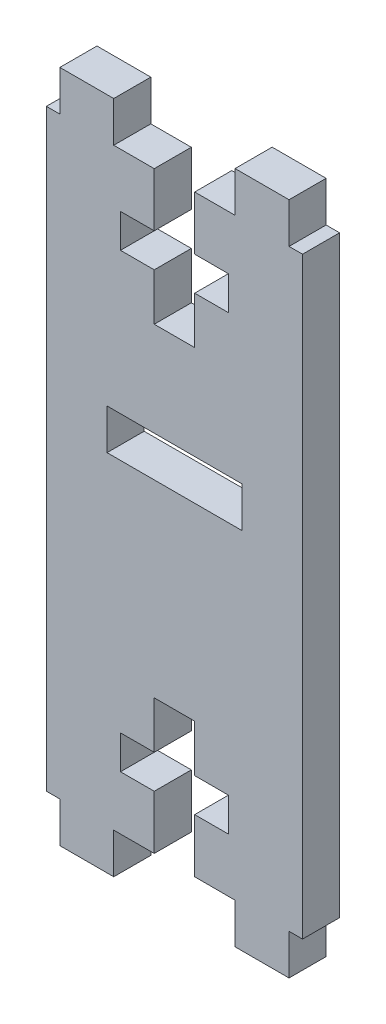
ISO-10303-21;
HEADER;
FILE_DESCRIPTION(('STEP AP214'),'2;1');
FILE_NAME('part.step','',(''),(''),'','','');
FILE_SCHEMA(('AUTOMOTIVE_DESIGN { 1 0 10303 214 1 1 1 1 }'));
ENDSEC;
DATA;
#1=APPLICATION_CONTEXT('core data for automotive mechanical design processes');
#2=APPLICATION_PROTOCOL_DEFINITION('international standard','automotive_design',2000,#1);
#3=PRODUCT_CONTEXT('',#1,'mechanical');
#4=PRODUCT('Part','Part','',(#3));
#5=PRODUCT_RELATED_PRODUCT_CATEGORY('part','',(#4));
#6=PRODUCT_DEFINITION_FORMATION('','',#4);
#7=PRODUCT_DEFINITION_CONTEXT('part definition',#1,'design');
#8=PRODUCT_DEFINITION('design','',#6,#7);
#9=PRODUCT_DEFINITION_SHAPE('','',#8);
#10=(LENGTH_UNIT() NAMED_UNIT(*) SI_UNIT(.MILLI.,.METRE.));
#11=(NAMED_UNIT(*) PLANE_ANGLE_UNIT() SI_UNIT($,.RADIAN.));
#12=(NAMED_UNIT(*) SI_UNIT($,.STERADIAN.) SOLID_ANGLE_UNIT());
#13=UNCERTAINTY_MEASURE_WITH_UNIT(LENGTH_MEASURE(1.E-05),#10,'distance_accuracy_value','');
#14=(GEOMETRIC_REPRESENTATION_CONTEXT(3) GLOBAL_UNCERTAINTY_ASSIGNED_CONTEXT((#13)) GLOBAL_UNIT_ASSIGNED_CONTEXT((#10,
#11,#12)) REPRESENTATION_CONTEXT('',''));
#15=CARTESIAN_POINT('',(0.,0.,0.));
#16=DIRECTION('',(0.,0.,1.));
#17=DIRECTION('',(1.,0.,0.));
#18=AXIS2_PLACEMENT_3D('',#15,#16,#17);
#19=CARTESIAN_POINT('',(-6.98571896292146,-103.476422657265,3.));
#20=DIRECTION('',(1.,0.,0.));
#21=DIRECTION('',(0.,1.,0.));
#22=AXIS2_PLACEMENT_3D('',#19,#20,#21);
#23=PLANE('',#22);
#24=DIRECTION('',(0.,-1.,0.));
#25=VECTOR('',#24,1.);
#26=CARTESIAN_POINT('',(-6.98571896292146,-103.476422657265,2.74999999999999));
#27=LINE('',#26,#25);
#28=CARTESIAN_POINT('',(-6.98571896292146,-103.48,2.74999999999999));
#29=VERTEX_POINT('',#28);
#30=CARTESIAN_POINT('',(-6.98571896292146,-107.476422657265,2.74999999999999));
#31=VERTEX_POINT('',#30);
#32=EDGE_CURVE('E878',#29,#31,#27,.T.);
#33=ORIENTED_EDGE('',*,*,#32,.F.);
#34=DIRECTION('',(0.,0.,1.));
#35=VECTOR('',#34,1.);
#36=CARTESIAN_POINT('',(-6.98571896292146,-103.48,3.));
#37=LINE('',#36,#35);
#38=CARTESIAN_POINT('',(-6.98571896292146,-103.48,0.));
#39=VERTEX_POINT('',#38);
#40=EDGE_CURVE('E762',#39,#29,#37,.T.);
#41=ORIENTED_EDGE('',*,*,#40,.F.);
#42=DIRECTION('',(0.,1.,0.));
#43=VECTOR('',#42,1.);
#44=CARTESIAN_POINT('',(-6.98571896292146,-103.476422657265,0.));
#45=LINE('',#44,#43);
#46=CARTESIAN_POINT('',(-6.98571896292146,-107.476422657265,0.));
#47=VERTEX_POINT('',#46);
#48=EDGE_CURVE('E533',#47,#39,#45,.T.);
#49=ORIENTED_EDGE('',*,*,#48,.F.);
#50=DIRECTION('',(0.,0.,1.));
#51=VECTOR('',#50,1.);
#52=CARTESIAN_POINT('',(-6.98571896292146,-107.476422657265,3.));
#53=LINE('',#52,#51);
#54=EDGE_CURVE('E536',#31,#47,#53,.F.);
#55=ORIENTED_EDGE('',*,*,#54,.F.);
#56=EDGE_LOOP('',(#33,#41,#49,#55));
#57=FACE_BOUND('',#56,.T.);
#58=ADVANCED_FACE('F31',(#57),#23,.F.);
#59=CARTESIAN_POINT('',(-5.48571896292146,-103.476422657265,3.));
#60=DIRECTION('',(1.,0.,0.));
#61=DIRECTION('',(0.,1.,0.));
#62=AXIS2_PLACEMENT_3D('',#59,#60,#61);
#63=PLANE('',#62);
#64=DIRECTION('',(0.,-1.,0.));
#65=VECTOR('',#64,1.);
#66=CARTESIAN_POINT('',(-5.48571896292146,-103.476422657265,2.74999999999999));
#67=LINE('',#66,#65);
#68=CARTESIAN_POINT('',(-5.48571896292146,-100.976422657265,2.75));
#69=VERTEX_POINT('',#68);
#70=CARTESIAN_POINT('',(-5.48571896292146,-100.98,2.75));
#71=VERTEX_POINT('',#70);
#72=EDGE_CURVE('E876',#69,#71,#67,.T.);
#73=ORIENTED_EDGE('',*,*,#72,.F.);
#74=DIRECTION('',(0.,0.,1.));
#75=VECTOR('',#74,1.);
#76=CARTESIAN_POINT('',(-5.48571896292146,-100.976422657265,3.));
#77=LINE('',#76,#75);
#78=CARTESIAN_POINT('',(-5.48571896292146,-100.976422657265,0.));
#79=VERTEX_POINT('',#78);
#80=EDGE_CURVE('E530',#79,#69,#77,.T.);
#81=ORIENTED_EDGE('',*,*,#80,.F.);
#82=DIRECTION('',(0.,1.,0.));
#83=VECTOR('',#82,1.);
#84=CARTESIAN_POINT('',(-5.48571896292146,-103.476422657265,0.));
#85=LINE('',#84,#83);
#86=CARTESIAN_POINT('',(-5.48571896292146,-100.98,0.));
#87=VERTEX_POINT('',#86);
#88=EDGE_CURVE('E528',#87,#79,#85,.T.);
#89=ORIENTED_EDGE('',*,*,#88,.F.);
#90=DIRECTION('',(0.,0.,-1.));
#91=VECTOR('',#90,1.);
#92=CARTESIAN_POINT('',(-5.48571896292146,-100.98,3.));
#93=LINE('',#92,#91);
#94=EDGE_CURVE('E765',#71,#87,#93,.T.);
#95=ORIENTED_EDGE('',*,*,#94,.F.);
#96=EDGE_LOOP('',(#73,#81,#89,#95));
#97=FACE_BOUND('',#96,.T.);
#98=ADVANCED_FACE('F918',(#97),#63,.F.);
#99=CARTESIAN_POINT('',(-11.4857189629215,-103.476422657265,3.));
#100=DIRECTION('',(-1.,0.,0.));
#101=DIRECTION('',(0.,0.,1.));
#102=AXIS2_PLACEMENT_3D('',#99,#100,#101);
#103=PLANE('',#102);
#104=DIRECTION('',(0.,1.,0.));
#105=VECTOR('',#104,1.);
#106=CARTESIAN_POINT('',(-11.4857189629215,-103.476422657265,2.74999999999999));
#107=LINE('',#106,#105);
#108=CARTESIAN_POINT('',(-11.4857189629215,-100.98,2.75));
#109=VERTEX_POINT('',#108);
#110=CARTESIAN_POINT('',(-11.4857189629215,-100.976422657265,2.75));
#111=VERTEX_POINT('',#110);
#112=EDGE_CURVE('E626',#109,#111,#107,.T.);
#113=ORIENTED_EDGE('',*,*,#112,.F.);
#114=DIRECTION('',(0.,0.,1.));
#115=VECTOR('',#114,1.);
#116=CARTESIAN_POINT('',(-11.4857189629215,-100.98,3.));
#117=LINE('',#116,#115);
#118=CARTESIAN_POINT('',(-11.4857189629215,-100.98,0.));
#119=VERTEX_POINT('',#118);
#120=EDGE_CURVE('E39',#119,#109,#117,.T.);
#121=ORIENTED_EDGE('',*,*,#120,.F.);
#122=DIRECTION('',(0.,1.,0.));
#123=VECTOR('',#122,1.);
#124=CARTESIAN_POINT('',(-11.4857189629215,-103.476422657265,0.));
#125=LINE('',#124,#123);
#126=CARTESIAN_POINT('',(-11.4857189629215,-100.976422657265,0.));
#127=VERTEX_POINT('',#126);
#128=EDGE_CURVE('E505',#127,#119,#125,.F.);
#129=ORIENTED_EDGE('',*,*,#128,.F.);
#130=DIRECTION('',(0.,0.,1.));
#131=VECTOR('',#130,1.);
#132=CARTESIAN_POINT('',(-11.4857189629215,-100.976422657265,3.));
#133=LINE('',#132,#131);
#134=EDGE_CURVE('E508',#111,#127,#133,.F.);
#135=ORIENTED_EDGE('',*,*,#134,.F.);
#136=EDGE_LOOP('',(#113,#121,#129,#135));
#137=FACE_BOUND('',#136,.T.);
#138=ADVANCED_FACE('F624',(#137),#103,.F.);
#139=CARTESIAN_POINT('',(-9.98571896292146,-103.476422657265,3.));
#140=DIRECTION('',(-1.,0.,0.));
#141=DIRECTION('',(0.,0.,1.));
#142=AXIS2_PLACEMENT_3D('',#139,#140,#141);
#143=PLANE('',#142);
#144=DIRECTION('',(0.,1.,0.));
#145=VECTOR('',#144,1.);
#146=CARTESIAN_POINT('',(-9.98571896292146,-103.476422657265,2.74999999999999));
#147=LINE('',#146,#145);
#148=CARTESIAN_POINT('',(-9.98571896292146,-107.476422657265,2.74999999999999));
#149=VERTEX_POINT('',#148);
#150=CARTESIAN_POINT('',(-9.98571896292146,-103.48,2.74999999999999));
#151=VERTEX_POINT('',#150);
#152=EDGE_CURVE('E651',#149,#151,#147,.T.);
#153=ORIENTED_EDGE('',*,*,#152,.F.);
#154=DIRECTION('',(0.,0.,1.));
#155=VECTOR('',#154,1.);
#156=CARTESIAN_POINT('',(-9.98571896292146,-107.476422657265,3.));
#157=LINE('',#156,#155);
#158=CARTESIAN_POINT('',(-9.98571896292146,-107.476422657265,0.));
#159=VERTEX_POINT('',#158);
#160=EDGE_CURVE('E500',#149,#159,#157,.F.);
#161=ORIENTED_EDGE('',*,*,#160,.T.);
#162=DIRECTION('',(0.,1.,0.));
#163=VECTOR('',#162,1.);
#164=CARTESIAN_POINT('',(-9.98571896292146,-103.476422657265,0.));
#165=LINE('',#164,#163);
#166=CARTESIAN_POINT('',(-9.98571896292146,-103.48,0.));
#167=VERTEX_POINT('',#166);
#168=EDGE_CURVE('E502',#167,#159,#165,.F.);
#169=ORIENTED_EDGE('',*,*,#168,.F.);
#170=DIRECTION('',(0.,0.,-1.));
#171=VECTOR('',#170,1.);
#172=CARTESIAN_POINT('',(-9.98571896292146,-103.48,3.));
#173=LINE('',#172,#171);
#174=EDGE_CURVE('E611',#151,#167,#173,.T.);
#175=ORIENTED_EDGE('',*,*,#174,.F.);
#176=EDGE_LOOP('',(#153,#161,#169,#175));
#177=FACE_BOUND('',#176,.T.);
#178=ADVANCED_FACE('F971',(#177),#143,.F.);
#179=CARTESIAN_POINT('',(-11.4857189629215,-69.9764226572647,3.));
#180=DIRECTION('',(-1.,0.,0.));
#181=DIRECTION('',(0.,0.,1.));
#182=AXIS2_PLACEMENT_3D('',#179,#180,#181);
#183=PLANE('',#182);
#184=DIRECTION('',(0.,1.,0.));
#185=VECTOR('',#184,1.);
#186=CARTESIAN_POINT('',(-11.4857189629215,-69.9764226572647,2.75));
#187=LINE('',#186,#185);
#188=CARTESIAN_POINT('',(-11.4857189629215,-67.48,2.75));
#189=VERTEX_POINT('',#188);
#190=CARTESIAN_POINT('',(-11.4857189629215,-67.4764226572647,2.75));
#191=VERTEX_POINT('',#190);
#192=EDGE_CURVE('E674',#189,#191,#187,.T.);
#193=ORIENTED_EDGE('',*,*,#192,.F.);
#194=DIRECTION('',(0.,0.,1.));
#195=VECTOR('',#194,1.);
#196=CARTESIAN_POINT('',(-11.4857189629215,-67.48,3.));
#197=LINE('',#196,#195);
#198=CARTESIAN_POINT('',(-11.4857189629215,-67.48,0.));
#199=VERTEX_POINT('',#198);
#200=EDGE_CURVE('E789',#199,#189,#197,.T.);
#201=ORIENTED_EDGE('',*,*,#200,.F.);
#202=DIRECTION('',(0.,1.,0.));
#203=VECTOR('',#202,1.);
#204=CARTESIAN_POINT('',(-11.4857189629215,-69.9764226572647,0.));
#205=LINE('',#204,#203);
#206=CARTESIAN_POINT('',(-11.4857189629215,-67.4764226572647,0.));
#207=VERTEX_POINT('',#206);
#208=EDGE_CURVE('E576',#207,#199,#205,.F.);
#209=ORIENTED_EDGE('',*,*,#208,.F.);
#210=DIRECTION('',(0.,0.,1.));
#211=VECTOR('',#210,1.);
#212=CARTESIAN_POINT('',(-11.4857189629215,-67.4764226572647,3.));
#213=LINE('',#212,#211);
#214=EDGE_CURVE('E579',#191,#207,#213,.F.);
#215=ORIENTED_EDGE('',*,*,#214,.F.);
#216=EDGE_LOOP('',(#193,#201,#209,#215));
#217=FACE_BOUND('',#216,.T.);
#218=ADVANCED_FACE('F967',(#217),#183,.F.);
#219=CARTESIAN_POINT('',(-9.98571896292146,-73.4764226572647,3.));
#220=DIRECTION('',(-1.,0.,0.));
#221=DIRECTION('',(0.,0.,1.));
#222=AXIS2_PLACEMENT_3D('',#219,#220,#221);
#223=PLANE('',#222);
#224=DIRECTION('',(0.,1.,0.));
#225=VECTOR('',#224,1.);
#226=CARTESIAN_POINT('',(-9.98571896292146,-73.4764226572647,2.75));
#227=LINE('',#226,#225);
#228=CARTESIAN_POINT('',(-9.98571896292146,-73.4764226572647,2.75));
#229=VERTEX_POINT('',#228);
#230=CARTESIAN_POINT('',(-9.98571896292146,-69.98,2.75));
#231=VERTEX_POINT('',#230);
#232=EDGE_CURVE('E672',#229,#231,#227,.T.);
#233=ORIENTED_EDGE('',*,*,#232,.F.);
#234=DIRECTION('',(0.,0.,-1.));
#235=VECTOR('',#234,1.);
#236=CARTESIAN_POINT('',(-9.98571896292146,-73.4764226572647,3.));
#237=LINE('',#236,#235);
#238=CARTESIAN_POINT('',(-9.98571896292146,-73.4764226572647,0.));
#239=VERTEX_POINT('',#238);
#240=EDGE_CURVE('E571',#229,#239,#237,.T.);
#241=ORIENTED_EDGE('',*,*,#240,.T.);
#242=DIRECTION('',(0.,1.,0.));
#243=VECTOR('',#242,1.);
#244=CARTESIAN_POINT('',(-9.98571896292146,-73.4764226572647,0.));
#245=LINE('',#244,#243);
#246=CARTESIAN_POINT('',(-9.98571896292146,-69.98,0.));
#247=VERTEX_POINT('',#246);
#248=EDGE_CURVE('E573',#247,#239,#245,.F.);
#249=ORIENTED_EDGE('',*,*,#248,.F.);
#250=DIRECTION('',(0.,0.,-1.));
#251=VECTOR('',#250,1.);
#252=CARTESIAN_POINT('',(-9.98571896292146,-69.98,3.));
#253=LINE('',#252,#251);
#254=EDGE_CURVE('E792',#231,#247,#253,.T.);
#255=ORIENTED_EDGE('',*,*,#254,.F.);
#256=EDGE_LOOP('',(#233,#241,#249,#255));
#257=FACE_BOUND('',#256,.T.);
#258=ADVANCED_FACE('F960',(#257),#223,.F.);
#259=CARTESIAN_POINT('',(-6.98571896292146,-73.4764226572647,3.));
#260=DIRECTION('',(1.,0.,0.));
#261=DIRECTION('',(0.,0.,-1.));
#262=AXIS2_PLACEMENT_3D('',#259,#260,#261);
#263=PLANE('',#262);
#264=DIRECTION('',(0.,-1.,0.));
#265=VECTOR('',#264,1.);
#266=CARTESIAN_POINT('',(-6.98571896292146,-73.4764226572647,2.75));
#267=LINE('',#266,#265);
#268=CARTESIAN_POINT('',(-6.98571896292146,-69.98,2.75));
#269=VERTEX_POINT('',#268);
#270=CARTESIAN_POINT('',(-6.98571896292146,-73.4764226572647,2.75));
#271=VERTEX_POINT('',#270);
#272=EDGE_CURVE('E682',#269,#271,#267,.T.);
#273=ORIENTED_EDGE('',*,*,#272,.F.);
#274=DIRECTION('',(0.,0.,1.));
#275=VECTOR('',#274,1.);
#276=CARTESIAN_POINT('',(-6.98571896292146,-69.98,3.));
#277=LINE('',#276,#275);
#278=CARTESIAN_POINT('',(-6.98571896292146,-69.98,0.));
#279=VERTEX_POINT('',#278);
#280=EDGE_CURVE('E608',#279,#269,#277,.T.);
#281=ORIENTED_EDGE('',*,*,#280,.F.);
#282=DIRECTION('',(0.,1.,0.));
#283=VECTOR('',#282,1.);
#284=CARTESIAN_POINT('',(-6.98571896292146,-73.4764226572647,0.));
#285=LINE('',#284,#283);
#286=CARTESIAN_POINT('',(-6.98571896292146,-73.4764226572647,0.));
#287=VERTEX_POINT('',#286);
#288=EDGE_CURVE('E563',#287,#279,#285,.T.);
#289=ORIENTED_EDGE('',*,*,#288,.F.);
#290=DIRECTION('',(0.,0.,-1.));
#291=VECTOR('',#290,1.);
#292=CARTESIAN_POINT('',(-6.98571896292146,-73.4764226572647,3.));
#293=LINE('',#292,#291);
#294=EDGE_CURVE('E566',#271,#287,#293,.T.);
#295=ORIENTED_EDGE('',*,*,#294,.F.);
#296=EDGE_LOOP('',(#273,#281,#289,#295));
#297=FACE_BOUND('',#296,.T.);
#298=ADVANCED_FACE('F956',(#297),#263,.F.);
#299=CARTESIAN_POINT('',(-5.48571896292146,-69.9764226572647,3.));
#300=DIRECTION('',(1.,0.,0.));
#301=DIRECTION('',(0.,0.,-1.));
#302=AXIS2_PLACEMENT_3D('',#299,#300,#301);
#303=PLANE('',#302);
#304=DIRECTION('',(0.,-1.,0.));
#305=VECTOR('',#304,1.);
#306=CARTESIAN_POINT('',(-5.48571896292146,-69.9764226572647,2.75));
#307=LINE('',#306,#305);
#308=CARTESIAN_POINT('',(-5.48571896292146,-67.4764226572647,2.75));
#309=VERTEX_POINT('',#308);
#310=CARTESIAN_POINT('',(-5.48571896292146,-67.48,2.75));
#311=VERTEX_POINT('',#310);
#312=EDGE_CURVE('E699',#309,#311,#307,.T.);
#313=ORIENTED_EDGE('',*,*,#312,.F.);
#314=DIRECTION('',(0.,0.,-1.));
#315=VECTOR('',#314,1.);
#316=CARTESIAN_POINT('',(-5.48571896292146,-67.4764226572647,3.));
#317=LINE('',#316,#315);
#318=CARTESIAN_POINT('',(-5.48571896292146,-67.4764226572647,0.));
#319=VERTEX_POINT('',#318);
#320=EDGE_CURVE('E560',#319,#309,#317,.F.);
#321=ORIENTED_EDGE('',*,*,#320,.F.);
#322=DIRECTION('',(0.,1.,0.));
#323=VECTOR('',#322,1.);
#324=CARTESIAN_POINT('',(-5.48571896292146,-69.9764226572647,0.));
#325=LINE('',#324,#323);
#326=CARTESIAN_POINT('',(-5.48571896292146,-67.48,0.));
#327=VERTEX_POINT('',#326);
#328=EDGE_CURVE('E558',#327,#319,#325,.T.);
#329=ORIENTED_EDGE('',*,*,#328,.F.);
#330=DIRECTION('',(0.,0.,-1.));
#331=VECTOR('',#330,1.);
#332=CARTESIAN_POINT('',(-5.48571896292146,-67.48,3.));
#333=LINE('',#332,#331);
#334=EDGE_CURVE('E606',#311,#327,#333,.T.);
#335=ORIENTED_EDGE('',*,*,#334,.F.);
#336=EDGE_LOOP('',(#313,#321,#329,#335));
#337=FACE_BOUND('',#336,.T.);
#338=ADVANCED_FACE('F952',(#337),#303,.F.);
#339=CARTESIAN_POINT('',(-17.9857189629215,-60.4764226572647,3.));
#340=DIRECTION('',(0.,-1.,0.));
#341=DIRECTION('',(0.,0.,-1.));
#342=AXIS2_PLACEMENT_3D('',#339,#340,#341);
#343=PLANE('',#342);
#344=DIRECTION('',(-1.,0.,0.));
#345=VECTOR('',#344,1.);
#346=CARTESIAN_POINT('',(3.,-60.4764226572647,2.75));
#347=LINE('',#346,#345);
#348=CARTESIAN_POINT('',(-12.99,-60.4764226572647,2.75));
#349=VERTEX_POINT('',#348);
#350=CARTESIAN_POINT('',(-16.9857189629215,-60.4764226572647,2.75));
#351=VERTEX_POINT('',#350);
#352=EDGE_CURVE('E869',#349,#351,#347,.T.);
#353=ORIENTED_EDGE('',*,*,#352,.F.);
#354=DIRECTION('',(0.,0.,1.));
#355=VECTOR('',#354,1.);
#356=CARTESIAN_POINT('',(-12.99,-60.4764226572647,3.));
#357=LINE('',#356,#355);
#358=CARTESIAN_POINT('',(-12.99,-60.4764226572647,0.));
#359=VERTEX_POINT('',#358);
#360=EDGE_CURVE('E603',#359,#349,#357,.T.);
#361=ORIENTED_EDGE('',*,*,#360,.F.);
#362=DIRECTION('',(1.,0.,0.));
#363=VECTOR('',#362,1.);
#364=CARTESIAN_POINT('',(-17.9857189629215,-60.4764226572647,0.));
#365=LINE('',#364,#363);
#366=CARTESIAN_POINT('',(-16.9857189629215,-60.4764226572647,0.));
#367=VERTEX_POINT('',#366);
#368=EDGE_CURVE('E586',#367,#359,#365,.T.);
#369=ORIENTED_EDGE('',*,*,#368,.F.);
#370=DIRECTION('',(0.,0.,-1.));
#371=VECTOR('',#370,1.);
#372=CARTESIAN_POINT('',(-16.9857189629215,-60.4764226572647,3.));
#373=LINE('',#372,#371);
#374=EDGE_CURVE('E800',#351,#367,#373,.T.);
#375=ORIENTED_EDGE('',*,*,#374,.F.);
#376=EDGE_LOOP('',(#353,#361,#369,#375));
#377=FACE_BOUND('',#376,.T.);
#378=ADVANCED_FACE('F955',(#377),#343,.F.);
#379=CARTESIAN_POINT('',(-17.9857189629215,-110.476422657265,3.));
#380=DIRECTION('',(1.,0.,0.));
#381=DIRECTION('',(0.,0.,-1.));
#382=AXIS2_PLACEMENT_3D('',#379,#380,#381);
#383=PLANE('',#382);
#384=DIRECTION('',(0.,-1.,0.));
#385=VECTOR('',#384,1.);
#386=CARTESIAN_POINT('',(-17.9857189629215,-110.476422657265,2.74999999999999));
#387=LINE('',#386,#385);
#388=CARTESIAN_POINT('',(-17.9857189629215,-63.4764226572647,2.75));
#389=VERTEX_POINT('',#388);
#390=CARTESIAN_POINT('',(-17.9857189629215,-107.476422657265,2.74999999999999));
#391=VERTEX_POINT('',#390);
#392=EDGE_CURVE('E717',#389,#391,#387,.T.);
#393=ORIENTED_EDGE('',*,*,#392,.F.);
#394=DIRECTION('',(0.,0.,-1.));
#395=VECTOR('',#394,1.);
#396=CARTESIAN_POINT('',(-17.9857189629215,-63.4764226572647,3.));
#397=LINE('',#396,#395);
#398=CARTESIAN_POINT('',(-17.9857189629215,-63.4764226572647,0.));
#399=VERTEX_POINT('',#398);
#400=EDGE_CURVE('E804',#389,#399,#397,.T.);
#401=ORIENTED_EDGE('',*,*,#400,.T.);
#402=DIRECTION('',(0.,1.,0.));
#403=VECTOR('',#402,1.);
#404=CARTESIAN_POINT('',(-17.9857189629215,-110.476422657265,0.));
#405=LINE('',#404,#403);
#406=CARTESIAN_POINT('',(-17.9857189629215,-107.476422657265,0.));
#407=VERTEX_POINT('',#406);
#408=EDGE_CURVE('E486',#407,#399,#405,.T.);
#409=ORIENTED_EDGE('',*,*,#408,.F.);
#410=DIRECTION('',(0.,0.,-1.));
#411=VECTOR('',#410,1.);
#412=CARTESIAN_POINT('',(-17.9857189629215,-107.476422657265,3.));
#413=LINE('',#412,#411);
#414=EDGE_CURVE('E840',#391,#407,#413,.T.);
#415=ORIENTED_EDGE('',*,*,#414,.F.);
#416=EDGE_LOOP('',(#393,#401,#409,#415));
#417=FACE_BOUND('',#416,.T.);
#418=ADVANCED_FACE('F947',(#417),#383,.F.);
#419=CARTESIAN_POINT('',(-4.98571896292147,-60.4764226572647,3.));
#420=DIRECTION('',(0.,-1.,0.));
#421=DIRECTION('',(0.,0.,-1.));
#422=AXIS2_PLACEMENT_3D('',#419,#420,#421);
#423=PLANE('',#422);
#424=CARTESIAN_POINT('',(0.014281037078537,-60.4764226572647,2.75));
#425=VERTEX_POINT('',#424);
#426=CARTESIAN_POINT('',(-3.99,-60.4764226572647,2.75));
#427=VERTEX_POINT('',#426);
#428=EDGE_CURVE('E865',#425,#427,#347,.T.);
#429=ORIENTED_EDGE('',*,*,#428,.F.);
#430=DIRECTION('',(0.,0.,-1.));
#431=VECTOR('',#430,1.);
#432=CARTESIAN_POINT('',(0.014281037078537,-60.4764226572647,3.));
#433=LINE('',#432,#431);
#434=CARTESIAN_POINT('',(0.014281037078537,-60.4764226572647,0.));
#435=VERTEX_POINT('',#434);
#436=EDGE_CURVE('E816',#425,#435,#433,.T.);
#437=ORIENTED_EDGE('',*,*,#436,.T.);
#438=DIRECTION('',(1.,0.,0.));
#439=VECTOR('',#438,1.);
#440=CARTESIAN_POINT('',(-4.98571896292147,-60.4764226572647,0.));
#441=LINE('',#440,#439);
#442=CARTESIAN_POINT('',(-3.99,-60.4764226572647,0.));
#443=VERTEX_POINT('',#442);
#444=EDGE_CURVE('E550',#443,#435,#441,.T.);
#445=ORIENTED_EDGE('',*,*,#444,.F.);
#446=DIRECTION('',(0.,0.,-1.));
#447=VECTOR('',#446,1.);
#448=CARTESIAN_POINT('',(-3.99,-60.4764226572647,3.));
#449=LINE('',#448,#447);
#450=EDGE_CURVE('E467',#427,#443,#449,.T.);
#451=ORIENTED_EDGE('',*,*,#450,.F.);
#452=EDGE_LOOP('',(#429,#437,#445,#451));
#453=FACE_BOUND('',#452,.T.);
#454=ADVANCED_FACE('F868',(#453),#423,.F.);
#455=CARTESIAN_POINT('',(1.01428103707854,-110.476422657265,3.));
#456=DIRECTION('',(-1.,0.,0.));
#457=DIRECTION('',(0.,-1.,0.));
#458=AXIS2_PLACEMENT_3D('',#455,#456,#457);
#459=PLANE('',#458);
#460=DIRECTION('',(0.,1.,0.));
#461=VECTOR('',#460,1.);
#462=CARTESIAN_POINT('',(1.01428103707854,-110.476422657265,2.74999999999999));
#463=LINE('',#462,#461);
#464=CARTESIAN_POINT('',(1.01428103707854,-107.476422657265,2.74999999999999));
#465=VERTEX_POINT('',#464);
#466=CARTESIAN_POINT('',(1.01428103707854,-63.4764226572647,2.75));
#467=VERTEX_POINT('',#466);
#468=EDGE_CURVE('E731',#465,#467,#463,.T.);
#469=ORIENTED_EDGE('',*,*,#468,.F.);
#470=DIRECTION('',(0.,0.,-1.));
#471=VECTOR('',#470,1.);
#472=CARTESIAN_POINT('',(1.01428103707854,-107.476422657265,3.));
#473=LINE('',#472,#471);
#474=CARTESIAN_POINT('',(1.01428103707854,-107.476422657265,0.));
#475=VERTEX_POINT('',#474);
#476=EDGE_CURVE('E434',#465,#475,#473,.T.);
#477=ORIENTED_EDGE('',*,*,#476,.T.);
#478=DIRECTION('',(0.,-1.,0.));
#479=VECTOR('',#478,1.);
#480=CARTESIAN_POINT('',(1.01428103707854,-110.476422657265,0.));
#481=LINE('',#480,#479);
#482=CARTESIAN_POINT('',(1.01428103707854,-63.4764226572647,0.));
#483=VERTEX_POINT('',#482);
#484=EDGE_CURVE('E547',#483,#475,#481,.T.);
#485=ORIENTED_EDGE('',*,*,#484,.F.);
#486=DIRECTION('',(0.,0.,-1.));
#487=VECTOR('',#486,1.);
#488=CARTESIAN_POINT('',(1.01428103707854,-63.4764226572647,3.));
#489=LINE('',#488,#487);
#490=EDGE_CURVE('E812',#467,#483,#489,.T.);
#491=ORIENTED_EDGE('',*,*,#490,.F.);
#492=EDGE_LOOP('',(#469,#477,#485,#491));
#493=FACE_BOUND('',#492,.T.);
#494=ADVANCED_FACE('F854',(#493),#459,.F.);
#495=CARTESIAN_POINT('',(-9.98571896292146,-67.4764226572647,3.));
#496=DIRECTION('',(-1.,0.,0.));
#497=DIRECTION('',(0.,0.,1.));
#498=AXIS2_PLACEMENT_3D('',#495,#496,#497);
#499=PLANE('',#498);
#500=DIRECTION('',(0.,1.,0.));
#501=VECTOR('',#500,1.);
#502=CARTESIAN_POINT('',(-9.98571896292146,-67.4764226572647,2.75));
#503=LINE('',#502,#501);
#504=CARTESIAN_POINT('',(-9.98571896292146,-67.4764226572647,2.75));
#505=VERTEX_POINT('',#504);
#506=CARTESIAN_POINT('',(-9.98571896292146,-63.48,2.75));
#507=VERTEX_POINT('',#506);
#508=EDGE_CURVE('E680',#505,#507,#503,.T.);
#509=ORIENTED_EDGE('',*,*,#508,.F.);
#510=DIRECTION('',(0.,0.,1.));
#511=VECTOR('',#510,1.);
#512=CARTESIAN_POINT('',(-9.98571896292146,-67.4764226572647,3.));
#513=LINE('',#512,#511);
#514=CARTESIAN_POINT('',(-9.98571896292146,-67.4764226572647,0.));
#515=VERTEX_POINT('',#514);
#516=EDGE_CURVE('E583',#515,#505,#513,.T.);
#517=ORIENTED_EDGE('',*,*,#516,.F.);
#518=DIRECTION('',(0.,1.,0.));
#519=VECTOR('',#518,1.);
#520=CARTESIAN_POINT('',(-9.98571896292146,-67.4764226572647,0.));
#521=LINE('',#520,#519);
#522=CARTESIAN_POINT('',(-9.98571896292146,-63.48,0.));
#523=VERTEX_POINT('',#522);
#524=EDGE_CURVE('E581',#523,#515,#521,.F.);
#525=ORIENTED_EDGE('',*,*,#524,.F.);
#526=DIRECTION('',(0.,0.,-1.));
#527=VECTOR('',#526,1.);
#528=CARTESIAN_POINT('',(-9.98571896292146,-63.48,3.));
#529=LINE('',#528,#527);
#530=EDGE_CURVE('E832',#507,#523,#529,.T.);
#531=ORIENTED_EDGE('',*,*,#530,.F.);
#532=EDGE_LOOP('',(#509,#517,#525,#531));
#533=FACE_BOUND('',#532,.T.);
#534=ADVANCED_FACE('F944',(#533),#499,.F.);
#535=CARTESIAN_POINT('',(-6.98571896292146,-67.4764226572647,3.));
#536=DIRECTION('',(1.,0.,0.));
#537=DIRECTION('',(0.,0.,-1.));
#538=AXIS2_PLACEMENT_3D('',#535,#536,#537);
#539=PLANE('',#538);
#540=DIRECTION('',(0.,-1.,0.));
#541=VECTOR('',#540,1.);
#542=CARTESIAN_POINT('',(-6.98571896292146,-67.4764226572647,2.75));
#543=LINE('',#542,#541);
#544=CARTESIAN_POINT('',(-6.98571896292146,-63.48,2.75));
#545=VERTEX_POINT('',#544);
#546=CARTESIAN_POINT('',(-6.98571896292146,-67.4764226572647,2.75));
#547=VERTEX_POINT('',#546);
#548=EDGE_CURVE('E703',#545,#547,#543,.T.);
#549=ORIENTED_EDGE('',*,*,#548,.F.);
#550=DIRECTION('',(0.,0.,1.));
#551=VECTOR('',#550,1.);
#552=CARTESIAN_POINT('',(-6.98571896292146,-63.48,3.));
#553=LINE('',#552,#551);
#554=CARTESIAN_POINT('',(-6.98571896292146,-63.48,0.));
#555=VERTEX_POINT('',#554);
#556=EDGE_CURVE('E600',#555,#545,#553,.T.);
#557=ORIENTED_EDGE('',*,*,#556,.F.);
#558=DIRECTION('',(0.,1.,0.));
#559=VECTOR('',#558,1.);
#560=CARTESIAN_POINT('',(-6.98571896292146,-67.4764226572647,0.));
#561=LINE('',#560,#559);
#562=CARTESIAN_POINT('',(-6.98571896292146,-67.4764226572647,0.));
#563=VERTEX_POINT('',#562);
#564=EDGE_CURVE('E553',#563,#555,#561,.T.);
#565=ORIENTED_EDGE('',*,*,#564,.F.);
#566=DIRECTION('',(0.,0.,-1.));
#567=VECTOR('',#566,1.);
#568=CARTESIAN_POINT('',(-6.98571896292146,-67.4764226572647,3.));
#569=LINE('',#568,#567);
#570=EDGE_CURVE('E556',#547,#563,#569,.T.);
#571=ORIENTED_EDGE('',*,*,#570,.F.);
#572=EDGE_LOOP('',(#549,#557,#565,#571));
#573=FACE_BOUND('',#572,.T.);
#574=ADVANCED_FACE('F948',(#573),#539,.F.);
#575=CARTESIAN_POINT('',(-17.9857189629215,-110.476422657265,3.));
#576=DIRECTION('',(0.,1.,0.));
#577=DIRECTION('',(0.,0.,1.));
#578=AXIS2_PLACEMENT_3D('',#575,#576,#577);
#579=PLANE('',#578);
#580=DIRECTION('',(-1.,0.,0.));
#581=VECTOR('',#580,1.);
#582=CARTESIAN_POINT('',(3.,-110.476422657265,2.74999999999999));
#583=LINE('',#582,#581);
#584=CARTESIAN_POINT('',(-12.99,-110.476422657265,2.74999999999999));
#585=VERTEX_POINT('',#584);
#586=CARTESIAN_POINT('',(-16.9857189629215,-110.476422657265,2.74999999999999));
#587=VERTEX_POINT('',#586);
#588=EDGE_CURVE('E417',#585,#587,#583,.T.);
#589=ORIENTED_EDGE('',*,*,#588,.T.);
#590=DIRECTION('',(0.,0.,-1.));
#591=VECTOR('',#590,1.);
#592=CARTESIAN_POINT('',(-16.9857189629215,-110.476422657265,3.));
#593=LINE('',#592,#591);
#594=CARTESIAN_POINT('',(-16.9857189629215,-110.476422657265,0.));
#595=VERTEX_POINT('',#594);
#596=EDGE_CURVE('E844',#587,#595,#593,.T.);
#597=ORIENTED_EDGE('',*,*,#596,.T.);
#598=DIRECTION('',(1.,0.,0.));
#599=VECTOR('',#598,1.);
#600=CARTESIAN_POINT('',(-17.9857189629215,-110.476422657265,0.));
#601=LINE('',#600,#599);
#602=CARTESIAN_POINT('',(-12.99,-110.476422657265,0.));
#603=VERTEX_POINT('',#602);
#604=EDGE_CURVE('E489',#603,#595,#601,.F.);
#605=ORIENTED_EDGE('',*,*,#604,.F.);
#606=DIRECTION('',(0.,0.,-1.));
#607=VECTOR('',#606,1.);
#608=CARTESIAN_POINT('',(-12.99,-110.476422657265,3.));
#609=LINE('',#608,#607);
#610=EDGE_CURVE('E462',#585,#603,#609,.T.);
#611=ORIENTED_EDGE('',*,*,#610,.F.);
#612=EDGE_LOOP('',(#589,#597,#605,#611));
#613=FACE_BOUND('',#612,.T.);
#614=ADVANCED_FACE('F941',(#613),#579,.F.);
#615=CARTESIAN_POINT('',(-4.98571896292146,-110.476422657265,3.));
#616=DIRECTION('',(0.,1.,0.));
#617=DIRECTION('',(0.,0.,1.));
#618=AXIS2_PLACEMENT_3D('',#615,#616,#617);
#619=PLANE('',#618);
#620=CARTESIAN_POINT('',(0.0142810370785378,-110.476422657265,2.74999999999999));
#621=VERTEX_POINT('',#620);
#622=CARTESIAN_POINT('',(-3.99,-110.476422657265,2.74999999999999));
#623=VERTEX_POINT('',#622);
#624=EDGE_CURVE('E405',#621,#623,#583,.T.);
#625=ORIENTED_EDGE('',*,*,#624,.T.);
#626=DIRECTION('',(0.,0.,1.));
#627=VECTOR('',#626,1.);
#628=CARTESIAN_POINT('',(-3.99,-110.476422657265,3.));
#629=LINE('',#628,#627);
#630=CARTESIAN_POINT('',(-3.99,-110.476422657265,0.));
#631=VERTEX_POINT('',#630);
#632=EDGE_CURVE('E460',#631,#623,#629,.T.);
#633=ORIENTED_EDGE('',*,*,#632,.F.);
#634=DIRECTION('',(1.,0.,0.));
#635=VECTOR('',#634,1.);
#636=CARTESIAN_POINT('',(-4.98571896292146,-110.476422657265,0.));
#637=LINE('',#636,#635);
#638=CARTESIAN_POINT('',(0.0142810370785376,-110.476422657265,0.));
#639=VERTEX_POINT('',#638);
#640=EDGE_CURVE('E431',#639,#631,#637,.F.);
#641=ORIENTED_EDGE('',*,*,#640,.F.);
#642=DIRECTION('',(0.,0.,-1.));
#643=VECTOR('',#642,1.);
#644=CARTESIAN_POINT('',(0.0142810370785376,-110.476422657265,3.));
#645=LINE('',#644,#643);
#646=EDGE_CURVE('E423',#621,#639,#645,.T.);
#647=ORIENTED_EDGE('',*,*,#646,.F.);
#648=EDGE_LOOP('',(#625,#633,#641,#647));
#649=FACE_BOUND('',#648,.T.);
#650=ADVANCED_FACE('F430',(#649),#619,.F.);
#651=CARTESIAN_POINT('',(-4.98571896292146,-107.476422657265,3.));
#652=DIRECTION('',(1.,0.,0.));
#653=DIRECTION('',(0.,0.,-1.));
#654=AXIS2_PLACEMENT_3D('',#651,#652,#653);
#655=PLANE('',#654);
#656=DIRECTION('',(0.,-1.,0.));
#657=VECTOR('',#656,1.);
#658=CARTESIAN_POINT('',(-4.98571896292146,-107.476422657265,2.74999999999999));
#659=LINE('',#658,#657);
#660=CARTESIAN_POINT('',(-4.98571896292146,-107.476422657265,2.74999999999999));
#661=VERTEX_POINT('',#660);
#662=CARTESIAN_POINT('',(-4.98571896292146,-107.48,2.74999999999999));
#663=VERTEX_POINT('',#662);
#664=EDGE_CURVE('E884',#661,#663,#659,.T.);
#665=ORIENTED_EDGE('',*,*,#664,.F.);
#666=DIRECTION('',(0.,0.,1.));
#667=VECTOR('',#666,1.);
#668=CARTESIAN_POINT('',(-4.98571896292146,-107.476422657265,3.));
#669=LINE('',#668,#667);
#670=CARTESIAN_POINT('',(-4.98571896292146,-107.476422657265,0.));
#671=VERTEX_POINT('',#670);
#672=EDGE_CURVE('E541',#661,#671,#669,.F.);
#673=ORIENTED_EDGE('',*,*,#672,.T.);
#674=DIRECTION('',(0.,1.,0.));
#675=VECTOR('',#674,1.);
#676=CARTESIAN_POINT('',(-4.98571896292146,-107.476422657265,0.));
#677=LINE('',#676,#675);
#678=CARTESIAN_POINT('',(-4.98571896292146,-107.48,0.));
#679=VERTEX_POINT('',#678);
#680=EDGE_CURVE('E543',#679,#671,#677,.T.);
#681=ORIENTED_EDGE('',*,*,#680,.F.);
#682=DIRECTION('',(0.,0.,-1.));
#683=VECTOR('',#682,1.);
#684=CARTESIAN_POINT('',(-4.98571896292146,-107.48,3.));
#685=LINE('',#684,#683);
#686=EDGE_CURVE('E458',#663,#679,#685,.T.);
#687=ORIENTED_EDGE('',*,*,#686,.F.);
#688=EDGE_LOOP('',(#665,#673,#681,#687));
#689=FACE_BOUND('',#688,.T.);
#690=ADVANCED_FACE('F934',(#689),#655,.F.);
#691=CARTESIAN_POINT('',(-11.9857189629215,-107.476422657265,3.));
#692=DIRECTION('',(-1.,0.,0.));
#693=DIRECTION('',(0.,0.,1.));
#694=AXIS2_PLACEMENT_3D('',#691,#692,#693);
#695=PLANE('',#694);
#696=DIRECTION('',(0.,1.,0.));
#697=VECTOR('',#696,1.);
#698=CARTESIAN_POINT('',(-11.9857189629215,-107.476422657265,2.74999999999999));
#699=LINE('',#698,#697);
#700=CARTESIAN_POINT('',(-11.9857189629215,-107.48,2.74999999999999));
#701=VERTEX_POINT('',#700);
#702=CARTESIAN_POINT('',(-11.9857189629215,-107.476422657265,2.74999999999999));
#703=VERTEX_POINT('',#702);
#704=EDGE_CURVE('E655',#701,#703,#699,.T.);
#705=ORIENTED_EDGE('',*,*,#704,.F.);
#706=DIRECTION('',(0.,0.,1.));
#707=VECTOR('',#706,1.);
#708=CARTESIAN_POINT('',(-11.9857189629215,-107.48,3.));
#709=LINE('',#708,#707);
#710=CARTESIAN_POINT('',(-11.9857189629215,-107.48,0.));
#711=VERTEX_POINT('',#710);
#712=EDGE_CURVE('E455',#711,#701,#709,.T.);
#713=ORIENTED_EDGE('',*,*,#712,.F.);
#714=DIRECTION('',(0.,1.,0.));
#715=VECTOR('',#714,1.);
#716=CARTESIAN_POINT('',(-11.9857189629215,-107.476422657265,0.));
#717=LINE('',#716,#715);
#718=CARTESIAN_POINT('',(-11.9857189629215,-107.476422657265,0.));
#719=VERTEX_POINT('',#718);
#720=EDGE_CURVE('E492',#719,#711,#717,.F.);
#721=ORIENTED_EDGE('',*,*,#720,.F.);
#722=DIRECTION('',(0.,0.,1.));
#723=VECTOR('',#722,1.);
#724=CARTESIAN_POINT('',(-11.9857189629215,-107.476422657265,3.));
#725=LINE('',#724,#723);
#726=EDGE_CURVE('E495',#703,#719,#725,.F.);
#727=ORIENTED_EDGE('',*,*,#726,.F.);
#728=EDGE_LOOP('',(#705,#713,#721,#727));
#729=FACE_BOUND('',#728,.T.);
#730=ADVANCED_FACE('F937',(#729),#695,.F.);
#731=CARTESIAN_POINT('',(-9.98571896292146,-67.4764226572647,3.));
#732=DIRECTION('',(0.,1.,0.));
#733=DIRECTION('',(0.,0.,1.));
#734=AXIS2_PLACEMENT_3D('',#731,#732,#733);
#735=PLANE('',#734);
#736=DIRECTION('',(1.,0.,0.));
#737=VECTOR('',#736,1.);
#738=CARTESIAN_POINT('',(-9.98571896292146,-67.4764226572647,2.75));
#739=LINE('',#738,#737);
#740=EDGE_CURVE('E678',#191,#505,#739,.T.);
#741=ORIENTED_EDGE('',*,*,#740,.F.);
#742=ORIENTED_EDGE('',*,*,#214,.T.);
#743=DIRECTION('',(-1.,0.,0.));
#744=VECTOR('',#743,1.);
#745=CARTESIAN_POINT('',(0.,-67.4764226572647,0.));
#746=LINE('',#745,#744);
#747=EDGE_CURVE('E464',#515,#207,#746,.T.);
#748=ORIENTED_EDGE('',*,*,#747,.F.);
#749=ORIENTED_EDGE('',*,*,#516,.T.);
#750=EDGE_LOOP('',(#741,#742,#748,#749));
#751=FACE_BOUND('',#750,.T.);
#752=ADVANCED_FACE('F33',(#751),#735,.F.);
#753=CARTESIAN_POINT('',(-5.48571896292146,-67.4764226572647,3.));
#754=DIRECTION('',(0.,1.,0.));
#755=DIRECTION('',(0.,0.,1.));
#756=AXIS2_PLACEMENT_3D('',#753,#754,#755);
#757=PLANE('',#756);
#758=DIRECTION('',(1.,0.,0.));
#759=VECTOR('',#758,1.);
#760=CARTESIAN_POINT('',(-5.48571896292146,-67.4764226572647,2.75));
#761=LINE('',#760,#759);
#762=EDGE_CURVE('E701',#547,#309,#761,.T.);
#763=ORIENTED_EDGE('',*,*,#762,.F.);
#764=ORIENTED_EDGE('',*,*,#570,.T.);
#765=DIRECTION('',(-1.,0.,0.));
#766=VECTOR('',#765,1.);
#767=CARTESIAN_POINT('',(0.,-67.4764226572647,0.));
#768=LINE('',#767,#766);
#769=EDGE_CURVE('E594',#319,#563,#768,.T.);
#770=ORIENTED_EDGE('',*,*,#769,.F.);
#771=ORIENTED_EDGE('',*,*,#320,.T.);
#772=EDGE_LOOP('',(#763,#764,#770,#771));
#773=FACE_BOUND('',#772,.T.);
#774=ADVANCED_FACE('F987',(#773),#757,.F.);
#775=CARTESIAN_POINT('',(-5.48571896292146,-100.976422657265,3.));
#776=DIRECTION('',(0.,1.,0.));
#777=DIRECTION('',(0.,0.,1.));
#778=AXIS2_PLACEMENT_3D('',#775,#776,#777);
#779=PLANE('',#778);
#780=DIRECTION('',(1.,0.,0.));
#781=VECTOR('',#780,1.);
#782=CARTESIAN_POINT('',(-5.48571896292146,-100.976422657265,2.75));
#783=LINE('',#782,#781);
#784=CARTESIAN_POINT('',(-6.98571896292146,-100.976422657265,2.75));
#785=VERTEX_POINT('',#784);
#786=EDGE_CURVE('E882',#785,#69,#783,.T.);
#787=ORIENTED_EDGE('',*,*,#786,.F.);
#788=DIRECTION('',(0.,0.,1.));
#789=VECTOR('',#788,1.);
#790=CARTESIAN_POINT('',(-6.98571896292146,-100.976422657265,3.));
#791=LINE('',#790,#789);
#792=CARTESIAN_POINT('',(-6.98571896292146,-100.976422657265,0.));
#793=VERTEX_POINT('',#792);
#794=EDGE_CURVE('E526',#785,#793,#791,.F.);
#795=ORIENTED_EDGE('',*,*,#794,.T.);
#796=DIRECTION('',(-1.,0.,0.));
#797=VECTOR('',#796,1.);
#798=CARTESIAN_POINT('',(0.,-100.976422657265,0.));
#799=LINE('',#798,#797);
#800=EDGE_CURVE('E591',#79,#793,#799,.T.);
#801=ORIENTED_EDGE('',*,*,#800,.F.);
#802=ORIENTED_EDGE('',*,*,#80,.T.);
#803=EDGE_LOOP('',(#787,#795,#801,#802));
#804=FACE_BOUND('',#803,.T.);
#805=ADVANCED_FACE('F985',(#804),#779,.F.);
#806=CARTESIAN_POINT('',(-9.98571896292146,-100.976422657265,3.));
#807=DIRECTION('',(0.,1.,0.));
#808=DIRECTION('',(0.,0.,1.));
#809=AXIS2_PLACEMENT_3D('',#806,#807,#808);
#810=PLANE('',#809);
#811=DIRECTION('',(1.,0.,0.));
#812=VECTOR('',#811,1.);
#813=CARTESIAN_POINT('',(-9.98571896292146,-100.976422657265,2.75));
#814=LINE('',#813,#812);
#815=CARTESIAN_POINT('',(-9.98571896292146,-100.976422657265,2.75));
#816=VERTEX_POINT('',#815);
#817=EDGE_CURVE('E635',#111,#816,#814,.T.);
#818=ORIENTED_EDGE('',*,*,#817,.F.);
#819=ORIENTED_EDGE('',*,*,#134,.T.);
#820=DIRECTION('',(-1.,0.,0.));
#821=VECTOR('',#820,1.);
#822=CARTESIAN_POINT('',(0.,-100.976422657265,0.));
#823=LINE('',#822,#821);
#824=CARTESIAN_POINT('',(-9.98571896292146,-100.976422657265,0.));
#825=VERTEX_POINT('',#824);
#826=EDGE_CURVE('E588',#825,#127,#823,.T.);
#827=ORIENTED_EDGE('',*,*,#826,.F.);
#828=DIRECTION('',(0.,0.,1.));
#829=VECTOR('',#828,1.);
#830=CARTESIAN_POINT('',(-9.98571896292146,-100.976422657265,3.));
#831=LINE('',#830,#829);
#832=EDGE_CURVE('E515',#825,#816,#831,.T.);
#833=ORIENTED_EDGE('',*,*,#832,.T.);
#834=EDGE_LOOP('',(#818,#819,#827,#833));
#835=FACE_BOUND('',#834,.T.);
#836=ADVANCED_FACE('F634',(#835),#810,.F.);
#837=CARTESIAN_POINT('',(-9.98571896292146,-73.4764226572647,3.));
#838=DIRECTION('',(0.,-1.,0.));
#839=DIRECTION('',(0.,0.,-1.));
#840=AXIS2_PLACEMENT_3D('',#837,#838,#839);
#841=PLANE('',#840);
#842=DIRECTION('',(-1.,0.,0.));
#843=VECTOR('',#842,1.);
#844=CARTESIAN_POINT('',(-9.98571896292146,-73.4764226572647,2.75));
#845=LINE('',#844,#843);
#846=EDGE_CURVE('E676',#271,#229,#845,.T.);
#847=ORIENTED_EDGE('',*,*,#846,.F.);
#848=ORIENTED_EDGE('',*,*,#294,.T.);
#849=DIRECTION('',(1.,0.,0.));
#850=VECTOR('',#849,1.);
#851=CARTESIAN_POINT('',(-9.98571896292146,-73.4764226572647,0.));
#852=LINE('',#851,#850);
#853=EDGE_CURVE('E568',#239,#287,#852,.T.);
#854=ORIENTED_EDGE('',*,*,#853,.F.);
#855=ORIENTED_EDGE('',*,*,#240,.F.);
#856=EDGE_LOOP('',(#847,#848,#854,#855));
#857=FACE_BOUND('',#856,.T.);
#858=ADVANCED_FACE('F932',(#857),#841,.F.);
#859=CARTESIAN_POINT('',(-6.98571896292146,-107.476422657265,3.));
#860=DIRECTION('',(0.,1.,0.));
#861=DIRECTION('',(0.,0.,1.));
#862=AXIS2_PLACEMENT_3D('',#859,#860,#861);
#863=PLANE('',#862);
#864=DIRECTION('',(1.,0.,0.));
#865=VECTOR('',#864,1.);
#866=CARTESIAN_POINT('',(-6.98571896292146,-107.476422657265,2.74999999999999));
#867=LINE('',#866,#865);
#868=EDGE_CURVE('E880',#31,#661,#867,.T.);
#869=ORIENTED_EDGE('',*,*,#868,.F.);
#870=ORIENTED_EDGE('',*,*,#54,.T.);
#871=DIRECTION('',(1.,0.,0.));
#872=VECTOR('',#871,1.);
#873=CARTESIAN_POINT('',(-6.98571896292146,-107.476422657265,0.));
#874=LINE('',#873,#872);
#875=EDGE_CURVE('E538',#671,#47,#874,.F.);
#876=ORIENTED_EDGE('',*,*,#875,.F.);
#877=ORIENTED_EDGE('',*,*,#672,.F.);
#878=EDGE_LOOP('',(#869,#870,#876,#877));
#879=FACE_BOUND('',#878,.T.);
#880=ADVANCED_FACE('F929',(#879),#863,.F.);
#881=CARTESIAN_POINT('',(-6.98571896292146,-97.4764226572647,3.));
#882=DIRECTION('',(1.,0.,0.));
#883=DIRECTION('',(0.,1.,0.));
#884=AXIS2_PLACEMENT_3D('',#881,#882,#883);
#885=PLANE('',#884);
#886=DIRECTION('',(0.,-1.,0.));
#887=VECTOR('',#886,1.);
#888=CARTESIAN_POINT('',(-6.98571896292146,-97.4764226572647,2.75));
#889=LINE('',#888,#887);
#890=CARTESIAN_POINT('',(-6.98571896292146,-97.4764226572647,2.75));
#891=VERTEX_POINT('',#890);
#892=EDGE_CURVE('E890',#891,#785,#889,.T.);
#893=ORIENTED_EDGE('',*,*,#892,.F.);
#894=DIRECTION('',(0.,0.,1.));
#895=VECTOR('',#894,1.);
#896=CARTESIAN_POINT('',(-6.98571896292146,-97.4764226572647,3.));
#897=LINE('',#896,#895);
#898=CARTESIAN_POINT('',(-6.98571896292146,-97.4764226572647,0.));
#899=VERTEX_POINT('',#898);
#900=EDGE_CURVE('E521',#891,#899,#897,.F.);
#901=ORIENTED_EDGE('',*,*,#900,.T.);
#902=DIRECTION('',(0.,1.,0.));
#903=VECTOR('',#902,1.);
#904=CARTESIAN_POINT('',(-6.98571896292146,-97.4764226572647,0.));
#905=LINE('',#904,#903);
#906=EDGE_CURVE('E523',#793,#899,#905,.T.);
#907=ORIENTED_EDGE('',*,*,#906,.F.);
#908=ORIENTED_EDGE('',*,*,#794,.F.);
#909=EDGE_LOOP('',(#893,#901,#907,#908));
#910=FACE_BOUND('',#909,.T.);
#911=ADVANCED_FACE('F899',(#910),#885,.F.);
#912=CARTESIAN_POINT('',(-9.98571896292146,-97.4764226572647,3.));
#913=DIRECTION('',(0.,1.,0.));
#914=DIRECTION('',(0.,0.,1.));
#915=AXIS2_PLACEMENT_3D('',#912,#913,#914);
#916=PLANE('',#915);
#917=DIRECTION('',(1.,0.,0.));
#918=VECTOR('',#917,1.);
#919=CARTESIAN_POINT('',(-9.98571896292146,-97.4764226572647,2.75));
#920=LINE('',#919,#918);
#921=CARTESIAN_POINT('',(-9.98571896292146,-97.4764226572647,2.75));
#922=VERTEX_POINT('',#921);
#923=EDGE_CURVE('E640',#922,#891,#920,.T.);
#924=ORIENTED_EDGE('',*,*,#923,.F.);
#925=DIRECTION('',(0.,0.,1.));
#926=VECTOR('',#925,1.);
#927=CARTESIAN_POINT('',(-9.98571896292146,-97.4764226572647,3.));
#928=LINE('',#927,#926);
#929=CARTESIAN_POINT('',(-9.98571896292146,-97.4764226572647,0.));
#930=VERTEX_POINT('',#929);
#931=EDGE_CURVE('E513',#922,#930,#928,.F.);
#932=ORIENTED_EDGE('',*,*,#931,.T.);
#933=DIRECTION('',(1.,0.,0.));
#934=VECTOR('',#933,1.);
#935=CARTESIAN_POINT('',(-9.98571896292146,-97.4764226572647,0.));
#936=LINE('',#935,#934);
#937=EDGE_CURVE('E518',#899,#930,#936,.F.);
#938=ORIENTED_EDGE('',*,*,#937,.F.);
#939=ORIENTED_EDGE('',*,*,#900,.F.);
#940=EDGE_LOOP('',(#924,#932,#938,#939));
#941=FACE_BOUND('',#940,.T.);
#942=ADVANCED_FACE('F902',(#941),#916,.F.);
#943=CARTESIAN_POINT('',(-9.98571896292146,-97.4764226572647,3.));
#944=DIRECTION('',(-1.,0.,0.));
#945=DIRECTION('',(0.,0.,1.));
#946=AXIS2_PLACEMENT_3D('',#943,#944,#945);
#947=PLANE('',#946);
#948=DIRECTION('',(0.,1.,0.));
#949=VECTOR('',#948,1.);
#950=CARTESIAN_POINT('',(-9.98571896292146,-97.4764226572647,2.75));
#951=LINE('',#950,#949);
#952=EDGE_CURVE('E637',#816,#922,#951,.T.);
#953=ORIENTED_EDGE('',*,*,#952,.F.);
#954=ORIENTED_EDGE('',*,*,#832,.F.);
#955=DIRECTION('',(0.,1.,0.));
#956=VECTOR('',#955,1.);
#957=CARTESIAN_POINT('',(-9.98571896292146,-97.4764226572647,0.));
#958=LINE('',#957,#956);
#959=EDGE_CURVE('E510',#930,#825,#958,.F.);
#960=ORIENTED_EDGE('',*,*,#959,.F.);
#961=ORIENTED_EDGE('',*,*,#931,.F.);
#962=EDGE_LOOP('',(#953,#954,#960,#961));
#963=FACE_BOUND('',#962,.T.);
#964=ADVANCED_FACE('F904',(#963),#947,.F.);
#965=CARTESIAN_POINT('',(-11.9857189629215,-107.476422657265,3.));
#966=DIRECTION('',(0.,1.,0.));
#967=DIRECTION('',(0.,0.,1.));
#968=AXIS2_PLACEMENT_3D('',#965,#966,#967);
#969=PLANE('',#968);
#970=DIRECTION('',(1.,0.,0.));
#971=VECTOR('',#970,1.);
#972=CARTESIAN_POINT('',(-11.9857189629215,-107.476422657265,2.74999999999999));
#973=LINE('',#972,#971);
#974=EDGE_CURVE('E653',#703,#149,#973,.T.);
#975=ORIENTED_EDGE('',*,*,#974,.F.);
#976=ORIENTED_EDGE('',*,*,#726,.T.);
#977=DIRECTION('',(1.,0.,0.));
#978=VECTOR('',#977,1.);
#979=CARTESIAN_POINT('',(-11.9857189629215,-107.476422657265,0.));
#980=LINE('',#979,#978);
#981=EDGE_CURVE('E497',#159,#719,#980,.F.);
#982=ORIENTED_EDGE('',*,*,#981,.F.);
#983=ORIENTED_EDGE('',*,*,#160,.F.);
#984=EDGE_LOOP('',(#975,#976,#982,#983));
#985=FACE_BOUND('',#984,.T.);
#986=ADVANCED_FACE('F906',(#985),#969,.F.);
#987=CARTESIAN_POINT('',(-13.4857189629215,-83.4764226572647,3.));
#988=DIRECTION('',(0.,1.,0.));
#989=DIRECTION('',(0.,0.,1.));
#990=AXIS2_PLACEMENT_3D('',#987,#988,#989);
#991=PLANE('',#990);
#992=DIRECTION('',(0.,0.,-1.));
#993=VECTOR('',#992,1.);
#994=CARTESIAN_POINT('',(-13.4857189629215,-83.4764226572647,3.));
#995=LINE('',#994,#993);
#996=CARTESIAN_POINT('',(-13.4857189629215,-83.4764226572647,2.75));
#997=VERTEX_POINT('',#996);
#998=CARTESIAN_POINT('',(-13.4857189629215,-83.4764226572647,0.));
#999=VERTEX_POINT('',#998);
#1000=EDGE_CURVE('E465',#997,#999,#995,.T.);
#1001=ORIENTED_EDGE('',*,*,#1000,.F.);
#1002=DIRECTION('',(1.,0.,0.));
#1003=VECTOR('',#1002,1.);
#1004=CARTESIAN_POINT('',(-13.4857189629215,-83.4764226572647,2.75));
#1005=LINE('',#1004,#1003);
#1006=CARTESIAN_POINT('',(-3.48571896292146,-83.4764226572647,2.75));
#1007=VERTEX_POINT('',#1006);
#1008=EDGE_CURVE('E46',#997,#1007,#1005,.T.);
#1009=ORIENTED_EDGE('',*,*,#1008,.T.);
#1010=DIRECTION('',(0.,0.,1.));
#1011=VECTOR('',#1010,1.);
#1012=CARTESIAN_POINT('',(-3.48571896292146,-83.4764226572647,3.));
#1013=LINE('',#1012,#1011);
#1014=CARTESIAN_POINT('',(-3.48571896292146,-83.4764226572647,0.));
#1015=VERTEX_POINT('',#1014);
#1016=EDGE_CURVE('E478',#1015,#1007,#1013,.T.);
#1017=ORIENTED_EDGE('',*,*,#1016,.F.);
#1018=DIRECTION('',(1.,0.,0.));
#1019=VECTOR('',#1018,1.);
#1020=CARTESIAN_POINT('',(-13.4857189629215,-83.4764226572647,0.));
#1021=LINE('',#1020,#1019);
#1022=EDGE_CURVE('E483',#1015,#999,#1021,.F.);
#1023=ORIENTED_EDGE('',*,*,#1022,.T.);
#1024=EDGE_LOOP('',(#1001,#1009,#1017,#1023));
#1025=FACE_BOUND('',#1024,.T.);
#1026=ADVANCED_FACE('F912',(#1025),#991,.T.);
#1027=CARTESIAN_POINT('',(-3.48571896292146,-80.4764226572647,3.));
#1028=DIRECTION('',(-1.,0.,0.));
#1029=DIRECTION('',(0.,-1.,0.));
#1030=AXIS2_PLACEMENT_3D('',#1027,#1028,#1029);
#1031=PLANE('',#1030);
#1032=ORIENTED_EDGE('',*,*,#1016,.T.);
#1033=DIRECTION('',(0.,1.,0.));
#1034=VECTOR('',#1033,1.);
#1035=CARTESIAN_POINT('',(-3.48571896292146,-80.4764226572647,2.75));
#1036=LINE('',#1035,#1034);
#1037=CARTESIAN_POINT('',(-3.48571896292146,-80.4764226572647,2.75));
#1038=VERTEX_POINT('',#1037);
#1039=EDGE_CURVE('E738',#1007,#1038,#1036,.T.);
#1040=ORIENTED_EDGE('',*,*,#1039,.T.);
#1041=DIRECTION('',(0.,0.,-1.));
#1042=VECTOR('',#1041,1.);
#1043=CARTESIAN_POINT('',(-3.48571896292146,-80.4764226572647,3.));
#1044=LINE('',#1043,#1042);
#1045=CARTESIAN_POINT('',(-3.48571896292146,-80.4764226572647,0.));
#1046=VERTEX_POINT('',#1045);
#1047=EDGE_CURVE('E473',#1046,#1038,#1044,.F.);
#1048=ORIENTED_EDGE('',*,*,#1047,.F.);
#1049=DIRECTION('',(0.,-1.,0.));
#1050=VECTOR('',#1049,1.);
#1051=CARTESIAN_POINT('',(-3.48571896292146,-80.4764226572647,0.));
#1052=LINE('',#1051,#1050);
#1053=EDGE_CURVE('E481',#1046,#1015,#1052,.T.);
#1054=ORIENTED_EDGE('',*,*,#1053,.T.);
#1055=EDGE_LOOP('',(#1032,#1040,#1048,#1054));
#1056=FACE_BOUND('',#1055,.T.);
#1057=ADVANCED_FACE('F1171',(#1056),#1031,.T.);
#1058=CARTESIAN_POINT('',(-13.4857189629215,-80.4764226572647,3.));
#1059=DIRECTION('',(0.,-1.,0.));
#1060=DIRECTION('',(0.,0.,-1.));
#1061=AXIS2_PLACEMENT_3D('',#1058,#1059,#1060);
#1062=PLANE('',#1061);
#1063=ORIENTED_EDGE('',*,*,#1047,.T.);
#1064=DIRECTION('',(-1.,0.,0.));
#1065=VECTOR('',#1064,1.);
#1066=CARTESIAN_POINT('',(-13.4857189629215,-80.4764226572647,2.75));
#1067=LINE('',#1066,#1065);
#1068=CARTESIAN_POINT('',(-13.4857189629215,-80.4764226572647,2.75));
#1069=VERTEX_POINT('',#1068);
#1070=EDGE_CURVE('E735',#1038,#1069,#1067,.T.);
#1071=ORIENTED_EDGE('',*,*,#1070,.T.);
#1072=DIRECTION('',(0.,0.,-1.));
#1073=VECTOR('',#1072,1.);
#1074=CARTESIAN_POINT('',(-13.4857189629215,-80.4764226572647,3.));
#1075=LINE('',#1074,#1073);
#1076=CARTESIAN_POINT('',(-13.4857189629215,-80.4764226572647,0.));
#1077=VERTEX_POINT('',#1076);
#1078=EDGE_CURVE('E468',#1077,#1069,#1075,.F.);
#1079=ORIENTED_EDGE('',*,*,#1078,.F.);
#1080=DIRECTION('',(1.,0.,0.));
#1081=VECTOR('',#1080,1.);
#1082=CARTESIAN_POINT('',(-13.4857189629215,-80.4764226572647,0.));
#1083=LINE('',#1082,#1081);
#1084=EDGE_CURVE('E476',#1077,#1046,#1083,.T.);
#1085=ORIENTED_EDGE('',*,*,#1084,.T.);
#1086=EDGE_LOOP('',(#1063,#1071,#1079,#1085));
#1087=FACE_BOUND('',#1086,.T.);
#1088=ADVANCED_FACE('F1167',(#1087),#1062,.T.);
#1089=CARTESIAN_POINT('',(-13.4857189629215,-80.4764226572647,3.));
#1090=DIRECTION('',(1.,0.,0.));
#1091=DIRECTION('',(0.,0.,-1.));
#1092=AXIS2_PLACEMENT_3D('',#1089,#1090,#1091);
#1093=PLANE('',#1092);
#1094=ORIENTED_EDGE('',*,*,#1078,.T.);
#1095=DIRECTION('',(0.,-1.,0.));
#1096=VECTOR('',#1095,1.);
#1097=CARTESIAN_POINT('',(-13.4857189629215,-80.4764226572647,2.75));
#1098=LINE('',#1097,#1096);
#1099=EDGE_CURVE('E426',#1069,#997,#1098,.T.);
#1100=ORIENTED_EDGE('',*,*,#1099,.T.);
#1101=ORIENTED_EDGE('',*,*,#1000,.T.);
#1102=DIRECTION('',(0.,1.,0.));
#1103=VECTOR('',#1102,1.);
#1104=CARTESIAN_POINT('',(-13.4857189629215,-80.4764226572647,0.));
#1105=LINE('',#1104,#1103);
#1106=EDGE_CURVE('E471',#999,#1077,#1105,.T.);
#1107=ORIENTED_EDGE('',*,*,#1106,.T.);
#1108=EDGE_LOOP('',(#1094,#1100,#1101,#1107));
#1109=FACE_BOUND('',#1108,.T.);
#1110=ADVANCED_FACE('F1158',(#1109),#1093,.T.);
#1111=CARTESIAN_POINT('',(-12.99,-107.48,3.));
#1112=DIRECTION('',(0.,-1.,0.));
#1113=DIRECTION('',(0.,0.,-1.));
#1114=AXIS2_PLACEMENT_3D('',#1111,#1112,#1113);
#1115=PLANE('',#1114);
#1116=ORIENTED_EDGE('',*,*,#712,.T.);
#1117=DIRECTION('',(-1.,0.,0.));
#1118=VECTOR('',#1117,1.);
#1119=CARTESIAN_POINT('',(-12.99,-107.48,2.74999999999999));
#1120=LINE('',#1119,#1118);
#1121=CARTESIAN_POINT('',(-12.99,-107.48,2.74999999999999));
#1122=VERTEX_POINT('',#1121);
#1123=EDGE_CURVE('E657',#701,#1122,#1120,.T.);
#1124=ORIENTED_EDGE('',*,*,#1123,.T.);
#1125=DIRECTION('',(0.,0.,-1.));
#1126=VECTOR('',#1125,1.);
#1127=CARTESIAN_POINT('',(-12.99,-107.48,3.));
#1128=LINE('',#1127,#1126);
#1129=CARTESIAN_POINT('',(-12.99,-107.48,0.));
#1130=VERTEX_POINT('',#1129);
#1131=EDGE_CURVE('E451',#1122,#1130,#1128,.T.);
#1132=ORIENTED_EDGE('',*,*,#1131,.T.);
#1133=DIRECTION('',(-1.,0.,0.));
#1134=VECTOR('',#1133,1.);
#1135=CARTESIAN_POINT('',(-12.99,-107.48,0.));
#1136=LINE('',#1135,#1134);
#1137=EDGE_CURVE('E447',#711,#1130,#1136,.T.);
#1138=ORIENTED_EDGE('',*,*,#1137,.F.);
#1139=EDGE_LOOP('',(#1116,#1124,#1132,#1138));
#1140=FACE_BOUND('',#1139,.T.);
#1141=ADVANCED_FACE('F1090',(#1140),#1115,.T.);
#1142=CARTESIAN_POINT('',(-12.99,-110.48,3.));
#1143=DIRECTION('',(1.,0.,0.));
#1144=DIRECTION('',(0.,0.,-1.));
#1145=AXIS2_PLACEMENT_3D('',#1142,#1143,#1144);
#1146=PLANE('',#1145);
#1147=ORIENTED_EDGE('',*,*,#1131,.F.);
#1148=DIRECTION('',(0.,-1.,0.));
#1149=VECTOR('',#1148,1.);
#1150=CARTESIAN_POINT('',(-12.99,-110.48,2.74999999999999));
#1151=LINE('',#1150,#1149);
#1152=EDGE_CURVE('E660',#1122,#585,#1151,.T.);
#1153=ORIENTED_EDGE('',*,*,#1152,.T.);
#1154=ORIENTED_EDGE('',*,*,#610,.T.);
#1155=DIRECTION('',(0.,-1.,0.));
#1156=VECTOR('',#1155,1.);
#1157=CARTESIAN_POINT('',(-12.99,-110.48,0.));
#1158=LINE('',#1157,#1156);
#1159=EDGE_CURVE('E441',#1130,#603,#1158,.T.);
#1160=ORIENTED_EDGE('',*,*,#1159,.F.);
#1161=EDGE_LOOP('',(#1147,#1153,#1154,#1160));
#1162=FACE_BOUND('',#1161,.T.);
#1163=ADVANCED_FACE('F1085',(#1162),#1146,.T.);
#1164=CARTESIAN_POINT('',(-3.99,-110.48,3.));
#1165=DIRECTION('',(-1.,0.,0.));
#1166=DIRECTION('',(0.,0.,1.));
#1167=AXIS2_PLACEMENT_3D('',#1164,#1165,#1166);
#1168=PLANE('',#1167);
#1169=ORIENTED_EDGE('',*,*,#632,.T.);
#1170=DIRECTION('',(0.,1.,0.));
#1171=VECTOR('',#1170,1.);
#1172=CARTESIAN_POINT('',(-3.99,-110.48,2.74999999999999));
#1173=LINE('',#1172,#1171);
#1174=CARTESIAN_POINT('',(-3.99,-107.48,2.74999999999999));
#1175=VERTEX_POINT('',#1174);
#1176=EDGE_CURVE('E411',#623,#1175,#1173,.T.);
#1177=ORIENTED_EDGE('',*,*,#1176,.T.);
#1178=DIRECTION('',(0.,0.,-1.));
#1179=VECTOR('',#1178,1.);
#1180=CARTESIAN_POINT('',(-3.99,-107.48,3.));
#1181=LINE('',#1180,#1179);
#1182=CARTESIAN_POINT('',(-3.99,-107.48,0.));
#1183=VERTEX_POINT('',#1182);
#1184=EDGE_CURVE('E453',#1175,#1183,#1181,.T.);
#1185=ORIENTED_EDGE('',*,*,#1184,.T.);
#1186=DIRECTION('',(0.,1.,0.));
#1187=VECTOR('',#1186,1.);
#1188=CARTESIAN_POINT('',(-3.99,-110.48,0.));
#1189=LINE('',#1188,#1187);
#1190=EDGE_CURVE('E444',#631,#1183,#1189,.T.);
#1191=ORIENTED_EDGE('',*,*,#1190,.F.);
#1192=EDGE_LOOP('',(#1169,#1177,#1185,#1191));
#1193=FACE_BOUND('',#1192,.T.);
#1194=ADVANCED_FACE('F1159',(#1193),#1168,.T.);
#1195=ORIENTED_EDGE('',*,*,#1184,.F.);
#1196=DIRECTION('',(-1.,0.,0.));
#1197=VECTOR('',#1196,1.);
#1198=CARTESIAN_POINT('',(-12.99,-107.48,2.74999999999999));
#1199=LINE('',#1198,#1197);
#1200=EDGE_CURVE('E886',#1175,#663,#1199,.T.);
#1201=ORIENTED_EDGE('',*,*,#1200,.T.);
#1202=ORIENTED_EDGE('',*,*,#686,.T.);
#1203=EDGE_CURVE('E448',#1183,#679,#1136,.T.);
#1204=ORIENTED_EDGE('',*,*,#1203,.F.);
#1205=EDGE_LOOP('',(#1195,#1201,#1202,#1204));
#1206=FACE_BOUND('',#1205,.T.);
#1207=ADVANCED_FACE('F1155',(#1206),#1115,.T.);
#1208=CARTESIAN_POINT('',(1.01428103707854,-107.476422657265,3.));
#1209=DIRECTION('',(0.,-1.,0.));
#1210=DIRECTION('',(0.,0.,-1.));
#1211=AXIS2_PLACEMENT_3D('',#1208,#1209,#1210);
#1212=PLANE('',#1211);
#1213=ORIENTED_EDGE('',*,*,#476,.F.);
#1214=DIRECTION('',(-1.,0.,0.));
#1215=VECTOR('',#1214,1.);
#1216=CARTESIAN_POINT('',(1.01428103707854,-107.476422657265,2.74999999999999));
#1217=LINE('',#1216,#1215);
#1218=CARTESIAN_POINT('',(0.0142810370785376,-107.476422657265,2.74999999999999));
#1219=VERTEX_POINT('',#1218);
#1220=EDGE_CURVE('E427',#465,#1219,#1217,.T.);
#1221=ORIENTED_EDGE('',*,*,#1220,.T.);
#1222=DIRECTION('',(0.,0.,-1.));
#1223=VECTOR('',#1222,1.);
#1224=CARTESIAN_POINT('',(0.0142810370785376,-107.476422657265,3.));
#1225=LINE('',#1224,#1223);
#1226=CARTESIAN_POINT('',(0.0142810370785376,-107.476422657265,0.));
#1227=VERTEX_POINT('',#1226);
#1228=EDGE_CURVE('E425',#1219,#1227,#1225,.T.);
#1229=ORIENTED_EDGE('',*,*,#1228,.T.);
#1230=DIRECTION('',(-1.,0.,0.));
#1231=VECTOR('',#1230,1.);
#1232=CARTESIAN_POINT('',(1.01428103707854,-107.476422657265,0.));
#1233=LINE('',#1232,#1231);
#1234=EDGE_CURVE('E436',#475,#1227,#1233,.T.);
#1235=ORIENTED_EDGE('',*,*,#1234,.F.);
#1236=EDGE_LOOP('',(#1213,#1221,#1229,#1235));
#1237=FACE_BOUND('',#1236,.T.);
#1238=ADVANCED_FACE('F850',(#1237),#1212,.T.);
#1239=CARTESIAN_POINT('',(0.0142810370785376,-110.476422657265,3.));
#1240=DIRECTION('',(1.,0.,0.));
#1241=DIRECTION('',(0.,0.,-1.));
#1242=AXIS2_PLACEMENT_3D('',#1239,#1240,#1241);
#1243=PLANE('',#1242);
#1244=ORIENTED_EDGE('',*,*,#1228,.F.);
#1245=DIRECTION('',(0.,-1.,0.));
#1246=VECTOR('',#1245,1.);
#1247=CARTESIAN_POINT('',(0.0142810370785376,-110.476422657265,2.74999999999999));
#1248=LINE('',#1247,#1246);
#1249=EDGE_CURVE('E408',#1219,#621,#1248,.T.);
#1250=ORIENTED_EDGE('',*,*,#1249,.T.);
#1251=ORIENTED_EDGE('',*,*,#646,.T.);
#1252=DIRECTION('',(0.,-1.,0.));
#1253=VECTOR('',#1252,1.);
#1254=CARTESIAN_POINT('',(0.0142810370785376,-110.476422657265,0.));
#1255=LINE('',#1254,#1253);
#1256=EDGE_CURVE('E432',#1227,#639,#1255,.T.);
#1257=ORIENTED_EDGE('',*,*,#1256,.F.);
#1258=EDGE_LOOP('',(#1244,#1250,#1251,#1257));
#1259=FACE_BOUND('',#1258,.T.);
#1260=ADVANCED_FACE('F421',(#1259),#1243,.T.);
#1261=CARTESIAN_POINT('',(-16.9857189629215,-110.476422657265,3.));
#1262=DIRECTION('',(-1.,0.,0.));
#1263=DIRECTION('',(0.,0.,1.));
#1264=AXIS2_PLACEMENT_3D('',#1261,#1262,#1263);
#1265=PLANE('',#1264);
#1266=ORIENTED_EDGE('',*,*,#596,.F.);
#1267=DIRECTION('',(0.,1.,0.));
#1268=VECTOR('',#1267,1.);
#1269=CARTESIAN_POINT('',(-16.9857189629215,-110.476422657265,2.74999999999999));
#1270=LINE('',#1269,#1268);
#1271=CARTESIAN_POINT('',(-16.9857189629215,-107.476422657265,2.74999999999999));
#1272=VERTEX_POINT('',#1271);
#1273=EDGE_CURVE('E722',#587,#1272,#1270,.T.);
#1274=ORIENTED_EDGE('',*,*,#1273,.T.);
#1275=DIRECTION('',(0.,0.,-1.));
#1276=VECTOR('',#1275,1.);
#1277=CARTESIAN_POINT('',(-16.9857189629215,-107.476422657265,3.));
#1278=LINE('',#1277,#1276);
#1279=CARTESIAN_POINT('',(-16.9857189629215,-107.476422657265,0.));
#1280=VERTEX_POINT('',#1279);
#1281=EDGE_CURVE('E842',#1272,#1280,#1278,.T.);
#1282=ORIENTED_EDGE('',*,*,#1281,.T.);
#1283=DIRECTION('',(0.,1.,0.));
#1284=VECTOR('',#1283,1.);
#1285=CARTESIAN_POINT('',(-16.9857189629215,-110.476422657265,0.));
#1286=LINE('',#1285,#1284);
#1287=EDGE_CURVE('E834',#595,#1280,#1286,.T.);
#1288=ORIENTED_EDGE('',*,*,#1287,.F.);
#1289=EDGE_LOOP('',(#1266,#1274,#1282,#1288));
#1290=FACE_BOUND('',#1289,.T.);
#1291=ADVANCED_FACE('F1079',(#1290),#1265,.T.);
#1292=CARTESIAN_POINT('',(-17.9857189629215,-107.476422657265,3.));
#1293=DIRECTION('',(0.,-1.,0.));
#1294=DIRECTION('',(0.,0.,-1.));
#1295=AXIS2_PLACEMENT_3D('',#1292,#1293,#1294);
#1296=PLANE('',#1295);
#1297=ORIENTED_EDGE('',*,*,#1281,.F.);
#1298=DIRECTION('',(-1.,0.,0.));
#1299=VECTOR('',#1298,1.);
#1300=CARTESIAN_POINT('',(-17.9857189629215,-107.476422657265,2.74999999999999));
#1301=LINE('',#1300,#1299);
#1302=EDGE_CURVE('E719',#1272,#391,#1301,.T.);
#1303=ORIENTED_EDGE('',*,*,#1302,.T.);
#1304=ORIENTED_EDGE('',*,*,#414,.T.);
#1305=DIRECTION('',(-1.,0.,0.));
#1306=VECTOR('',#1305,1.);
#1307=CARTESIAN_POINT('',(-17.9857189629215,-107.476422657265,0.));
#1308=LINE('',#1307,#1306);
#1309=EDGE_CURVE('E837',#1280,#407,#1308,.T.);
#1310=ORIENTED_EDGE('',*,*,#1309,.F.);
#1311=EDGE_LOOP('',(#1297,#1303,#1304,#1310));
#1312=FACE_BOUND('',#1311,.T.);
#1313=ADVANCED_FACE('F1074',(#1312),#1296,.T.);
#1314=CARTESIAN_POINT('',(-3.99,-60.47,3.));
#1315=DIRECTION('',(-1.,0.,0.));
#1316=DIRECTION('',(0.,0.,1.));
#1317=AXIS2_PLACEMENT_3D('',#1314,#1315,#1316);
#1318=PLANE('',#1317);
#1319=DIRECTION('',(0.,0.,-1.));
#1320=VECTOR('',#1319,1.);
#1321=CARTESIAN_POINT('',(-3.99,-63.48,3.));
#1322=LINE('',#1321,#1320);
#1323=CARTESIAN_POINT('',(-3.99,-63.48,2.75));
#1324=VERTEX_POINT('',#1323);
#1325=CARTESIAN_POINT('',(-3.99,-63.48,0.));
#1326=VERTEX_POINT('',#1325);
#1327=EDGE_CURVE('E828',#1324,#1326,#1322,.T.);
#1328=ORIENTED_EDGE('',*,*,#1327,.F.);
#1329=DIRECTION('',(0.,1.,0.));
#1330=VECTOR('',#1329,1.);
#1331=CARTESIAN_POINT('',(-3.99,-60.47,2.75));
#1332=LINE('',#1331,#1330);
#1333=EDGE_CURVE('E708',#1324,#427,#1332,.T.);
#1334=ORIENTED_EDGE('',*,*,#1333,.T.);
#1335=ORIENTED_EDGE('',*,*,#450,.T.);
#1336=DIRECTION('',(0.,1.,0.));
#1337=VECTOR('',#1336,1.);
#1338=CARTESIAN_POINT('',(-3.99,-60.47,0.));
#1339=LINE('',#1338,#1337);
#1340=EDGE_CURVE('E825',#1326,#443,#1339,.T.);
#1341=ORIENTED_EDGE('',*,*,#1340,.F.);
#1342=EDGE_LOOP('',(#1328,#1334,#1335,#1341));
#1343=FACE_BOUND('',#1342,.T.);
#1344=ADVANCED_FACE('F1137',(#1343),#1318,.T.);
#1345=CARTESIAN_POINT('',(-12.99,-63.48,3.));
#1346=DIRECTION('',(0.,1.,0.));
#1347=DIRECTION('',(0.,0.,1.));
#1348=AXIS2_PLACEMENT_3D('',#1345,#1346,#1347);
#1349=PLANE('',#1348);
#1350=ORIENTED_EDGE('',*,*,#556,.T.);
#1351=DIRECTION('',(1.,0.,0.));
#1352=VECTOR('',#1351,1.);
#1353=CARTESIAN_POINT('',(-12.99,-63.48,2.75));
#1354=LINE('',#1353,#1352);
#1355=EDGE_CURVE('E705',#545,#1324,#1354,.T.);
#1356=ORIENTED_EDGE('',*,*,#1355,.T.);
#1357=ORIENTED_EDGE('',*,*,#1327,.T.);
#1358=DIRECTION('',(1.,0.,0.));
#1359=VECTOR('',#1358,1.);
#1360=CARTESIAN_POINT('',(-12.99,-63.48,0.));
#1361=LINE('',#1360,#1359);
#1362=EDGE_CURVE('E821',#555,#1326,#1361,.T.);
#1363=ORIENTED_EDGE('',*,*,#1362,.F.);
#1364=EDGE_LOOP('',(#1350,#1356,#1357,#1363));
#1365=FACE_BOUND('',#1364,.T.);
#1366=ADVANCED_FACE('F1140',(#1365),#1349,.T.);
#1367=CARTESIAN_POINT('',(-12.99,-60.47,3.));
#1368=DIRECTION('',(1.,0.,0.));
#1369=DIRECTION('',(0.,0.,-1.));
#1370=AXIS2_PLACEMENT_3D('',#1367,#1368,#1369);
#1371=PLANE('',#1370);
#1372=ORIENTED_EDGE('',*,*,#360,.T.);
#1373=DIRECTION('',(0.,-1.,0.));
#1374=VECTOR('',#1373,1.);
#1375=CARTESIAN_POINT('',(-12.99,-60.47,2.75));
#1376=LINE('',#1375,#1374);
#1377=CARTESIAN_POINT('',(-12.99,-63.48,2.75));
#1378=VERTEX_POINT('',#1377);
#1379=EDGE_CURVE('E690',#349,#1378,#1376,.T.);
#1380=ORIENTED_EDGE('',*,*,#1379,.T.);
#1381=DIRECTION('',(0.,0.,-1.));
#1382=VECTOR('',#1381,1.);
#1383=CARTESIAN_POINT('',(-12.99,-63.48,3.));
#1384=LINE('',#1383,#1382);
#1385=CARTESIAN_POINT('',(-12.99,-63.48,0.));
#1386=VERTEX_POINT('',#1385);
#1387=EDGE_CURVE('E830',#1378,#1386,#1384,.T.);
#1388=ORIENTED_EDGE('',*,*,#1387,.T.);
#1389=DIRECTION('',(0.,-1.,0.));
#1390=VECTOR('',#1389,1.);
#1391=CARTESIAN_POINT('',(-12.99,-60.47,0.));
#1392=LINE('',#1391,#1390);
#1393=EDGE_CURVE('E818',#359,#1386,#1392,.T.);
#1394=ORIENTED_EDGE('',*,*,#1393,.F.);
#1395=EDGE_LOOP('',(#1372,#1380,#1388,#1394));
#1396=FACE_BOUND('',#1395,.T.);
#1397=ADVANCED_FACE('F1056',(#1396),#1371,.T.);
#1398=ORIENTED_EDGE('',*,*,#1387,.F.);
#1399=DIRECTION('',(1.,0.,0.));
#1400=VECTOR('',#1399,1.);
#1401=CARTESIAN_POINT('',(-12.99,-63.48,2.75));
#1402=LINE('',#1401,#1400);
#1403=EDGE_CURVE('E687',#1378,#507,#1402,.T.);
#1404=ORIENTED_EDGE('',*,*,#1403,.T.);
#1405=ORIENTED_EDGE('',*,*,#530,.T.);
#1406=EDGE_CURVE('E822',#1386,#523,#1361,.T.);
#1407=ORIENTED_EDGE('',*,*,#1406,.F.);
#1408=EDGE_LOOP('',(#1398,#1404,#1405,#1407));
#1409=FACE_BOUND('',#1408,.T.);
#1410=ADVANCED_FACE('F1051',(#1409),#1349,.T.);
#1411=CARTESIAN_POINT('',(0.014281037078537,-60.4764226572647,3.));
#1412=DIRECTION('',(1.,0.,0.));
#1413=DIRECTION('',(0.,1.,0.));
#1414=AXIS2_PLACEMENT_3D('',#1411,#1412,#1413);
#1415=PLANE('',#1414);
#1416=ORIENTED_EDGE('',*,*,#436,.F.);
#1417=DIRECTION('',(0.,-1.,0.));
#1418=VECTOR('',#1417,1.);
#1419=CARTESIAN_POINT('',(0.014281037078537,-60.4764226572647,2.75));
#1420=LINE('',#1419,#1418);
#1421=CARTESIAN_POINT('',(0.0142810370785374,-63.4764226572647,2.75));
#1422=VERTEX_POINT('',#1421);
#1423=EDGE_CURVE('E728',#425,#1422,#1420,.T.);
#1424=ORIENTED_EDGE('',*,*,#1423,.T.);
#1425=DIRECTION('',(0.,0.,-1.));
#1426=VECTOR('',#1425,1.);
#1427=CARTESIAN_POINT('',(0.0142810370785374,-63.4764226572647,3.));
#1428=LINE('',#1427,#1426);
#1429=CARTESIAN_POINT('',(0.0142810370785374,-63.4764226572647,0.));
#1430=VERTEX_POINT('',#1429);
#1431=EDGE_CURVE('E814',#1422,#1430,#1428,.T.);
#1432=ORIENTED_EDGE('',*,*,#1431,.T.);
#1433=DIRECTION('',(0.,-1.,0.));
#1434=VECTOR('',#1433,1.);
#1435=CARTESIAN_POINT('',(0.014281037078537,-60.4764226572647,0.));
#1436=LINE('',#1435,#1434);
#1437=EDGE_CURVE('E806',#435,#1430,#1436,.T.);
#1438=ORIENTED_EDGE('',*,*,#1437,.F.);
#1439=EDGE_LOOP('',(#1416,#1424,#1432,#1438));
#1440=FACE_BOUND('',#1439,.T.);
#1441=ADVANCED_FACE('F863',(#1440),#1415,.T.);
#1442=CARTESIAN_POINT('',(1.01428103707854,-63.4764226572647,3.));
#1443=DIRECTION('',(0.,1.,0.));
#1444=DIRECTION('',(0.,0.,1.));
#1445=AXIS2_PLACEMENT_3D('',#1442,#1443,#1444);
#1446=PLANE('',#1445);
#1447=ORIENTED_EDGE('',*,*,#1431,.F.);
#1448=DIRECTION('',(1.,0.,0.));
#1449=VECTOR('',#1448,1.);
#1450=CARTESIAN_POINT('',(1.01428103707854,-63.4764226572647,2.75));
#1451=LINE('',#1450,#1449);
#1452=EDGE_CURVE('E725',#1422,#467,#1451,.T.);
#1453=ORIENTED_EDGE('',*,*,#1452,.T.);
#1454=ORIENTED_EDGE('',*,*,#490,.T.);
#1455=DIRECTION('',(1.,0.,0.));
#1456=VECTOR('',#1455,1.);
#1457=CARTESIAN_POINT('',(1.01428103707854,-63.4764226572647,0.));
#1458=LINE('',#1457,#1456);
#1459=EDGE_CURVE('E809',#1430,#483,#1458,.T.);
#1460=ORIENTED_EDGE('',*,*,#1459,.F.);
#1461=EDGE_LOOP('',(#1447,#1453,#1454,#1460));
#1462=FACE_BOUND('',#1461,.T.);
#1463=ADVANCED_FACE('F858',(#1462),#1446,.T.);
#1464=CARTESIAN_POINT('',(-17.9857189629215,-63.4764226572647,3.));
#1465=DIRECTION('',(0.,1.,0.));
#1466=DIRECTION('',(0.,0.,1.));
#1467=AXIS2_PLACEMENT_3D('',#1464,#1465,#1466);
#1468=PLANE('',#1467);
#1469=ORIENTED_EDGE('',*,*,#400,.F.);
#1470=DIRECTION('',(1.,0.,0.));
#1471=VECTOR('',#1470,1.);
#1472=CARTESIAN_POINT('',(-17.9857189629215,-63.4764226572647,2.75));
#1473=LINE('',#1472,#1471);
#1474=CARTESIAN_POINT('',(-16.9857189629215,-63.4764226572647,2.75));
#1475=VERTEX_POINT('',#1474);
#1476=EDGE_CURVE('E714',#389,#1475,#1473,.T.);
#1477=ORIENTED_EDGE('',*,*,#1476,.T.);
#1478=DIRECTION('',(0.,0.,-1.));
#1479=VECTOR('',#1478,1.);
#1480=CARTESIAN_POINT('',(-16.9857189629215,-63.4764226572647,3.));
#1481=LINE('',#1480,#1479);
#1482=CARTESIAN_POINT('',(-16.9857189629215,-63.4764226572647,0.));
#1483=VERTEX_POINT('',#1482);
#1484=EDGE_CURVE('E802',#1475,#1483,#1481,.T.);
#1485=ORIENTED_EDGE('',*,*,#1484,.T.);
#1486=DIRECTION('',(1.,0.,0.));
#1487=VECTOR('',#1486,1.);
#1488=CARTESIAN_POINT('',(-17.9857189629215,-63.4764226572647,0.));
#1489=LINE('',#1488,#1487);
#1490=EDGE_CURVE('E794',#399,#1483,#1489,.T.);
#1491=ORIENTED_EDGE('',*,*,#1490,.F.);
#1492=EDGE_LOOP('',(#1469,#1477,#1485,#1491));
#1493=FACE_BOUND('',#1492,.T.);
#1494=ADVANCED_FACE('F1066',(#1493),#1468,.T.);
#1495=CARTESIAN_POINT('',(-16.9857189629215,-60.4764226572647,3.));
#1496=DIRECTION('',(-1.,0.,0.));
#1497=DIRECTION('',(0.,0.,1.));
#1498=AXIS2_PLACEMENT_3D('',#1495,#1496,#1497);
#1499=PLANE('',#1498);
#1500=ORIENTED_EDGE('',*,*,#1484,.F.);
#1501=DIRECTION('',(0.,1.,0.));
#1502=VECTOR('',#1501,1.);
#1503=CARTESIAN_POINT('',(-16.9857189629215,-60.4764226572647,2.75));
#1504=LINE('',#1503,#1502);
#1505=EDGE_CURVE('E711',#1475,#351,#1504,.T.);
#1506=ORIENTED_EDGE('',*,*,#1505,.T.);
#1507=ORIENTED_EDGE('',*,*,#374,.T.);
#1508=DIRECTION('',(0.,1.,0.));
#1509=VECTOR('',#1508,1.);
#1510=CARTESIAN_POINT('',(-16.9857189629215,-60.4764226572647,0.));
#1511=LINE('',#1510,#1509);
#1512=EDGE_CURVE('E797',#1483,#367,#1511,.T.);
#1513=ORIENTED_EDGE('',*,*,#1512,.F.);
#1514=EDGE_LOOP('',(#1500,#1506,#1507,#1513));
#1515=FACE_BOUND('',#1514,.T.);
#1516=ADVANCED_FACE('F1061',(#1515),#1499,.T.);
#1517=CARTESIAN_POINT('',(-12.49,-69.98,3.));
#1518=DIRECTION('',(0.,1.,0.));
#1519=DIRECTION('',(0.,0.,1.));
#1520=AXIS2_PLACEMENT_3D('',#1517,#1518,#1519);
#1521=PLANE('',#1520);
#1522=ORIENTED_EDGE('',*,*,#280,.T.);
#1523=DIRECTION('',(1.,0.,0.));
#1524=VECTOR('',#1523,1.);
#1525=CARTESIAN_POINT('',(-12.49,-69.98,2.75));
#1526=LINE('',#1525,#1524);
#1527=CARTESIAN_POINT('',(-4.49,-69.98,2.75));
#1528=VERTEX_POINT('',#1527);
#1529=EDGE_CURVE('E684',#269,#1528,#1526,.T.);
#1530=ORIENTED_EDGE('',*,*,#1529,.T.);
#1531=DIRECTION('',(0.,0.,-1.));
#1532=VECTOR('',#1531,1.);
#1533=CARTESIAN_POINT('',(-4.49,-69.98,3.));
#1534=LINE('',#1533,#1532);
#1535=CARTESIAN_POINT('',(-4.49,-69.98,0.));
#1536=VERTEX_POINT('',#1535);
#1537=EDGE_CURVE('E785',#1528,#1536,#1534,.T.);
#1538=ORIENTED_EDGE('',*,*,#1537,.T.);
#1539=DIRECTION('',(1.,0.,0.));
#1540=VECTOR('',#1539,1.);
#1541=CARTESIAN_POINT('',(-12.49,-69.98,0.));
#1542=LINE('',#1541,#1540);
#1543=EDGE_CURVE('E770',#279,#1536,#1542,.T.);
#1544=ORIENTED_EDGE('',*,*,#1543,.F.);
#1545=EDGE_LOOP('',(#1522,#1530,#1538,#1544));
#1546=FACE_BOUND('',#1545,.T.);
#1547=ADVANCED_FACE('F1017',(#1546),#1521,.T.);
#1548=CARTESIAN_POINT('',(-12.49,-67.48,3.));
#1549=DIRECTION('',(0.,-1.,0.));
#1550=DIRECTION('',(0.,0.,-1.));
#1551=AXIS2_PLACEMENT_3D('',#1548,#1549,#1550);
#1552=PLANE('',#1551);
#1553=DIRECTION('',(0.,0.,-1.));
#1554=VECTOR('',#1553,1.);
#1555=CARTESIAN_POINT('',(-4.49,-67.48,3.));
#1556=LINE('',#1555,#1554);
#1557=CARTESIAN_POINT('',(-4.49,-67.48,2.75));
#1558=VERTEX_POINT('',#1557);
#1559=CARTESIAN_POINT('',(-4.49,-67.48,0.));
#1560=VERTEX_POINT('',#1559);
#1561=EDGE_CURVE('E783',#1558,#1560,#1556,.T.);
#1562=ORIENTED_EDGE('',*,*,#1561,.F.);
#1563=DIRECTION('',(-1.,0.,0.));
#1564=VECTOR('',#1563,1.);
#1565=CARTESIAN_POINT('',(-12.49,-67.48,2.75));
#1566=LINE('',#1565,#1564);
#1567=EDGE_CURVE('E696',#1558,#311,#1566,.T.);
#1568=ORIENTED_EDGE('',*,*,#1567,.T.);
#1569=ORIENTED_EDGE('',*,*,#334,.T.);
#1570=DIRECTION('',(-1.,0.,0.));
#1571=VECTOR('',#1570,1.);
#1572=CARTESIAN_POINT('',(-12.49,-67.48,0.));
#1573=LINE('',#1572,#1571);
#1574=EDGE_CURVE('E778',#1560,#327,#1573,.T.);
#1575=ORIENTED_EDGE('',*,*,#1574,.F.);
#1576=EDGE_LOOP('',(#1562,#1568,#1569,#1575));
#1577=FACE_BOUND('',#1576,.T.);
#1578=ADVANCED_FACE('F1009',(#1577),#1552,.T.);
#1579=CARTESIAN_POINT('',(-4.49,-67.48,3.));
#1580=DIRECTION('',(-1.,0.,0.));
#1581=DIRECTION('',(0.,0.,1.));
#1582=AXIS2_PLACEMENT_3D('',#1579,#1580,#1581);
#1583=PLANE('',#1582);
#1584=ORIENTED_EDGE('',*,*,#1537,.F.);
#1585=DIRECTION('',(0.,1.,0.));
#1586=VECTOR('',#1585,1.);
#1587=CARTESIAN_POINT('',(-4.49,-67.48,2.75));
#1588=LINE('',#1587,#1586);
#1589=EDGE_CURVE('E693',#1528,#1558,#1588,.T.);
#1590=ORIENTED_EDGE('',*,*,#1589,.T.);
#1591=ORIENTED_EDGE('',*,*,#1561,.T.);
#1592=DIRECTION('',(0.,1.,0.));
#1593=VECTOR('',#1592,1.);
#1594=CARTESIAN_POINT('',(-4.49,-67.48,0.));
#1595=LINE('',#1594,#1593);
#1596=EDGE_CURVE('E774',#1536,#1560,#1595,.T.);
#1597=ORIENTED_EDGE('',*,*,#1596,.F.);
#1598=EDGE_LOOP('',(#1584,#1590,#1591,#1597));
#1599=FACE_BOUND('',#1598,.T.);
#1600=ADVANCED_FACE('F1013',(#1599),#1583,.T.);
#1601=DIRECTION('',(0.,0.,-1.));
#1602=VECTOR('',#1601,1.);
#1603=CARTESIAN_POINT('',(-12.49,-69.98,3.));
#1604=LINE('',#1603,#1602);
#1605=CARTESIAN_POINT('',(-12.49,-69.98,2.75));
#1606=VERTEX_POINT('',#1605);
#1607=CARTESIAN_POINT('',(-12.49,-69.98,0.));
#1608=VERTEX_POINT('',#1607);
#1609=EDGE_CURVE('E787',#1606,#1608,#1604,.T.);
#1610=ORIENTED_EDGE('',*,*,#1609,.F.);
#1611=DIRECTION('',(1.,0.,0.));
#1612=VECTOR('',#1611,1.);
#1613=CARTESIAN_POINT('',(-12.49,-69.98,2.75));
#1614=LINE('',#1613,#1612);
#1615=EDGE_CURVE('E669',#1606,#231,#1614,.T.);
#1616=ORIENTED_EDGE('',*,*,#1615,.T.);
#1617=ORIENTED_EDGE('',*,*,#254,.T.);
#1618=EDGE_CURVE('E771',#1608,#247,#1542,.T.);
#1619=ORIENTED_EDGE('',*,*,#1618,.F.);
#1620=EDGE_LOOP('',(#1610,#1616,#1617,#1619));
#1621=FACE_BOUND('',#1620,.T.);
#1622=ADVANCED_FACE('F1030',(#1621),#1521,.T.);
#1623=ORIENTED_EDGE('',*,*,#200,.T.);
#1624=DIRECTION('',(-1.,0.,0.));
#1625=VECTOR('',#1624,1.);
#1626=CARTESIAN_POINT('',(-12.49,-67.48,2.75));
#1627=LINE('',#1626,#1625);
#1628=CARTESIAN_POINT('',(-12.49,-67.48,2.75));
#1629=VERTEX_POINT('',#1628);
#1630=EDGE_CURVE('E666',#189,#1629,#1627,.T.);
#1631=ORIENTED_EDGE('',*,*,#1630,.T.);
#1632=DIRECTION('',(0.,0.,-1.));
#1633=VECTOR('',#1632,1.);
#1634=CARTESIAN_POINT('',(-12.49,-67.48,3.));
#1635=LINE('',#1634,#1633);
#1636=CARTESIAN_POINT('',(-12.49,-67.48,0.));
#1637=VERTEX_POINT('',#1636);
#1638=EDGE_CURVE('E781',#1629,#1637,#1635,.T.);
#1639=ORIENTED_EDGE('',*,*,#1638,.T.);
#1640=EDGE_CURVE('E777',#199,#1637,#1573,.T.);
#1641=ORIENTED_EDGE('',*,*,#1640,.F.);
#1642=EDGE_LOOP('',(#1623,#1631,#1639,#1641));
#1643=FACE_BOUND('',#1642,.T.);
#1644=ADVANCED_FACE('F1038',(#1643),#1552,.T.);
#1645=CARTESIAN_POINT('',(-12.49,-67.48,3.));
#1646=DIRECTION('',(1.,0.,0.));
#1647=DIRECTION('',(0.,0.,-1.));
#1648=AXIS2_PLACEMENT_3D('',#1645,#1646,#1647);
#1649=PLANE('',#1648);
#1650=ORIENTED_EDGE('',*,*,#1638,.F.);
#1651=DIRECTION('',(0.,-1.,0.));
#1652=VECTOR('',#1651,1.);
#1653=CARTESIAN_POINT('',(-12.49,-67.48,2.75));
#1654=LINE('',#1653,#1652);
#1655=EDGE_CURVE('E663',#1629,#1606,#1654,.T.);
#1656=ORIENTED_EDGE('',*,*,#1655,.T.);
#1657=ORIENTED_EDGE('',*,*,#1609,.T.);
#1658=DIRECTION('',(0.,-1.,0.));
#1659=VECTOR('',#1658,1.);
#1660=CARTESIAN_POINT('',(-12.49,-67.48,0.));
#1661=LINE('',#1660,#1659);
#1662=EDGE_CURVE('E767',#1637,#1608,#1661,.T.);
#1663=ORIENTED_EDGE('',*,*,#1662,.F.);
#1664=EDGE_LOOP('',(#1650,#1656,#1657,#1663));
#1665=FACE_BOUND('',#1664,.T.);
#1666=ADVANCED_FACE('F1035',(#1665),#1649,.T.);
#1667=CARTESIAN_POINT('',(-12.49,-100.98,3.));
#1668=DIRECTION('',(0.,-1.,0.));
#1669=DIRECTION('',(0.,0.,-1.));
#1670=AXIS2_PLACEMENT_3D('',#1667,#1668,#1669);
#1671=PLANE('',#1670);
#1672=ORIENTED_EDGE('',*,*,#120,.T.);
#1673=DIRECTION('',(-1.,0.,0.));
#1674=VECTOR('',#1673,1.);
#1675=CARTESIAN_POINT('',(-12.49,-100.98,2.75));
#1676=LINE('',#1675,#1674);
#1677=CARTESIAN_POINT('',(-12.49,-100.98,2.75));
#1678=VERTEX_POINT('',#1677);
#1679=EDGE_CURVE('E617',#109,#1678,#1676,.T.);
#1680=ORIENTED_EDGE('',*,*,#1679,.T.);
#1681=DIRECTION('',(0.,0.,-1.));
#1682=VECTOR('',#1681,1.);
#1683=CARTESIAN_POINT('',(-12.49,-100.98,3.));
#1684=LINE('',#1683,#1682);
#1685=CARTESIAN_POINT('',(-12.49,-100.98,0.));
#1686=VERTEX_POINT('',#1685);
#1687=EDGE_CURVE('E754',#1678,#1686,#1684,.T.);
#1688=ORIENTED_EDGE('',*,*,#1687,.T.);
#1689=DIRECTION('',(-1.,0.,0.));
#1690=VECTOR('',#1689,1.);
#1691=CARTESIAN_POINT('',(-12.49,-100.98,0.));
#1692=LINE('',#1691,#1690);
#1693=EDGE_CURVE('E620',#119,#1686,#1692,.T.);
#1694=ORIENTED_EDGE('',*,*,#1693,.F.);
#1695=EDGE_LOOP('',(#1672,#1680,#1688,#1694));
#1696=FACE_BOUND('',#1695,.T.);
#1697=ADVANCED_FACE('F616',(#1696),#1671,.T.);
#1698=CARTESIAN_POINT('',(-12.49,-103.48,3.));
#1699=DIRECTION('',(0.,1.,0.));
#1700=DIRECTION('',(0.,0.,1.));
#1701=AXIS2_PLACEMENT_3D('',#1698,#1699,#1700);
#1702=PLANE('',#1701);
#1703=DIRECTION('',(0.,0.,-1.));
#1704=VECTOR('',#1703,1.);
#1705=CARTESIAN_POINT('',(-12.49,-103.48,3.));
#1706=LINE('',#1705,#1704);
#1707=CARTESIAN_POINT('',(-12.49,-103.48,2.74999999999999));
#1708=VERTEX_POINT('',#1707);
#1709=CARTESIAN_POINT('',(-12.49,-103.48,0.));
#1710=VERTEX_POINT('',#1709);
#1711=EDGE_CURVE('E760',#1708,#1710,#1706,.T.);
#1712=ORIENTED_EDGE('',*,*,#1711,.F.);
#1713=DIRECTION('',(1.,0.,0.));
#1714=VECTOR('',#1713,1.);
#1715=CARTESIAN_POINT('',(-12.49,-103.48,2.74999999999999));
#1716=LINE('',#1715,#1714);
#1717=EDGE_CURVE('E648',#1708,#151,#1716,.T.);
#1718=ORIENTED_EDGE('',*,*,#1717,.T.);
#1719=ORIENTED_EDGE('',*,*,#174,.T.);
#1720=DIRECTION('',(1.,0.,0.));
#1721=VECTOR('',#1720,1.);
#1722=CARTESIAN_POINT('',(-12.49,-103.48,0.));
#1723=LINE('',#1722,#1721);
#1724=EDGE_CURVE('E745',#1710,#167,#1723,.T.);
#1725=ORIENTED_EDGE('',*,*,#1724,.F.);
#1726=EDGE_LOOP('',(#1712,#1718,#1719,#1725));
#1727=FACE_BOUND('',#1726,.T.);
#1728=ADVANCED_FACE('F1105',(#1727),#1702,.T.);
#1729=CARTESIAN_POINT('',(-12.49,-100.98,3.));
#1730=DIRECTION('',(1.,0.,0.));
#1731=DIRECTION('',(0.,0.,-1.));
#1732=AXIS2_PLACEMENT_3D('',#1729,#1730,#1731);
#1733=PLANE('',#1732);
#1734=ORIENTED_EDGE('',*,*,#1687,.F.);
#1735=DIRECTION('',(0.,-1.,0.));
#1736=VECTOR('',#1735,1.);
#1737=CARTESIAN_POINT('',(-12.49,-100.98,2.75));
#1738=LINE('',#1737,#1736);
#1739=EDGE_CURVE('E645',#1678,#1708,#1738,.T.);
#1740=ORIENTED_EDGE('',*,*,#1739,.T.);
#1741=ORIENTED_EDGE('',*,*,#1711,.T.);
#1742=DIRECTION('',(0.,-1.,0.));
#1743=VECTOR('',#1742,1.);
#1744=CARTESIAN_POINT('',(-12.49,-100.98,0.));
#1745=LINE('',#1744,#1743);
#1746=EDGE_CURVE('E742',#1686,#1710,#1745,.T.);
#1747=ORIENTED_EDGE('',*,*,#1746,.F.);
#1748=EDGE_LOOP('',(#1734,#1740,#1741,#1747));
#1749=FACE_BOUND('',#1748,.T.);
#1750=ADVANCED_FACE('F1107',(#1749),#1733,.T.);
#1751=DIRECTION('',(0.,0.,-1.));
#1752=VECTOR('',#1751,1.);
#1753=CARTESIAN_POINT('',(-4.49,-100.98,3.));
#1754=LINE('',#1753,#1752);
#1755=CARTESIAN_POINT('',(-4.49,-100.98,2.74999999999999));
#1756=VERTEX_POINT('',#1755);
#1757=CARTESIAN_POINT('',(-4.49,-100.98,0.));
#1758=VERTEX_POINT('',#1757);
#1759=EDGE_CURVE('E756',#1756,#1758,#1754,.T.);
#1760=ORIENTED_EDGE('',*,*,#1759,.F.);
#1761=DIRECTION('',(-1.,0.,0.));
#1762=VECTOR('',#1761,1.);
#1763=CARTESIAN_POINT('',(-12.49,-100.98,2.75));
#1764=LINE('',#1763,#1762);
#1765=EDGE_CURVE('E54',#1756,#71,#1764,.T.);
#1766=ORIENTED_EDGE('',*,*,#1765,.T.);
#1767=ORIENTED_EDGE('',*,*,#94,.T.);
#1768=EDGE_CURVE('E751',#1758,#87,#1692,.T.);
#1769=ORIENTED_EDGE('',*,*,#1768,.F.);
#1770=EDGE_LOOP('',(#1760,#1766,#1767,#1769));
#1771=FACE_BOUND('',#1770,.T.);
#1772=ADVANCED_FACE('F1109',(#1771),#1671,.T.);
#1773=ORIENTED_EDGE('',*,*,#40,.T.);
#1774=DIRECTION('',(1.,0.,0.));
#1775=VECTOR('',#1774,1.);
#1776=CARTESIAN_POINT('',(-12.49,-103.48,2.74999999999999));
#1777=LINE('',#1776,#1775);
#1778=CARTESIAN_POINT('',(-4.49,-103.48,2.74999999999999));
#1779=VERTEX_POINT('',#1778);
#1780=EDGE_CURVE('E416',#29,#1779,#1777,.T.);
#1781=ORIENTED_EDGE('',*,*,#1780,.T.);
#1782=DIRECTION('',(0.,0.,-1.));
#1783=VECTOR('',#1782,1.);
#1784=CARTESIAN_POINT('',(-4.49,-103.48,3.));
#1785=LINE('',#1784,#1783);
#1786=CARTESIAN_POINT('',(-4.49,-103.48,0.));
#1787=VERTEX_POINT('',#1786);
#1788=EDGE_CURVE('E758',#1779,#1787,#1785,.T.);
#1789=ORIENTED_EDGE('',*,*,#1788,.T.);
#1790=EDGE_CURVE('E744',#39,#1787,#1723,.T.);
#1791=ORIENTED_EDGE('',*,*,#1790,.F.);
#1792=EDGE_LOOP('',(#1773,#1781,#1789,#1791));
#1793=FACE_BOUND('',#1792,.T.);
#1794=ADVANCED_FACE('F1115',(#1793),#1702,.T.);
#1795=CARTESIAN_POINT('',(-4.49,-100.98,3.));
#1796=DIRECTION('',(-1.,0.,0.));
#1797=DIRECTION('',(0.,0.,1.));
#1798=AXIS2_PLACEMENT_3D('',#1795,#1796,#1797);
#1799=PLANE('',#1798);
#1800=ORIENTED_EDGE('',*,*,#1788,.F.);
#1801=DIRECTION('',(0.,1.,0.));
#1802=VECTOR('',#1801,1.);
#1803=CARTESIAN_POINT('',(-4.49,-100.98,2.75));
#1804=LINE('',#1803,#1802);
#1805=EDGE_CURVE('E11',#1779,#1756,#1804,.T.);
#1806=ORIENTED_EDGE('',*,*,#1805,.T.);
#1807=ORIENTED_EDGE('',*,*,#1759,.T.);
#1808=DIRECTION('',(0.,1.,0.));
#1809=VECTOR('',#1808,1.);
#1810=CARTESIAN_POINT('',(-4.49,-100.98,0.));
#1811=LINE('',#1810,#1809);
#1812=EDGE_CURVE('E748',#1787,#1758,#1811,.T.);
#1813=ORIENTED_EDGE('',*,*,#1812,.F.);
#1814=EDGE_LOOP('',(#1800,#1806,#1807,#1813));
#1815=FACE_BOUND('',#1814,.T.);
#1816=ADVANCED_FACE('F981',(#1815),#1799,.T.);
#1817=CARTESIAN_POINT('',(0.,0.,0.));
#1818=DIRECTION('',(0.,0.,-1.));
#1819=DIRECTION('',(-1.,0.,0.));
#1820=AXIS2_PLACEMENT_3D('',#1817,#1818,#1819);
#1821=PLANE('',#1820);
#1822=ORIENTED_EDGE('',*,*,#1022,.F.);
#1823=ORIENTED_EDGE('',*,*,#1053,.F.);
#1824=ORIENTED_EDGE('',*,*,#1084,.F.);
#1825=ORIENTED_EDGE('',*,*,#1106,.F.);
#1826=EDGE_LOOP('',(#1822,#1823,#1824,#1825));
#1827=FACE_BOUND('',#1826,.T.);
#1828=ORIENTED_EDGE('',*,*,#48,.T.);
#1829=ORIENTED_EDGE('',*,*,#1790,.T.);
#1830=ORIENTED_EDGE('',*,*,#1812,.T.);
#1831=ORIENTED_EDGE('',*,*,#1768,.T.);
#1832=ORIENTED_EDGE('',*,*,#88,.T.);
#1833=ORIENTED_EDGE('',*,*,#800,.T.);
#1834=ORIENTED_EDGE('',*,*,#906,.T.);
#1835=ORIENTED_EDGE('',*,*,#937,.T.);
#1836=ORIENTED_EDGE('',*,*,#959,.T.);
#1837=ORIENTED_EDGE('',*,*,#826,.T.);
#1838=ORIENTED_EDGE('',*,*,#128,.T.);
#1839=ORIENTED_EDGE('',*,*,#1693,.T.);
#1840=ORIENTED_EDGE('',*,*,#1746,.T.);
#1841=ORIENTED_EDGE('',*,*,#1724,.T.);
#1842=ORIENTED_EDGE('',*,*,#168,.T.);
#1843=ORIENTED_EDGE('',*,*,#981,.T.);
#1844=ORIENTED_EDGE('',*,*,#720,.T.);
#1845=ORIENTED_EDGE('',*,*,#1137,.T.);
#1846=ORIENTED_EDGE('',*,*,#1159,.T.);
#1847=ORIENTED_EDGE('',*,*,#604,.T.);
#1848=ORIENTED_EDGE('',*,*,#1287,.T.);
#1849=ORIENTED_EDGE('',*,*,#1309,.T.);
#1850=ORIENTED_EDGE('',*,*,#408,.T.);
#1851=ORIENTED_EDGE('',*,*,#1490,.T.);
#1852=ORIENTED_EDGE('',*,*,#1512,.T.);
#1853=ORIENTED_EDGE('',*,*,#368,.T.);
#1854=ORIENTED_EDGE('',*,*,#1393,.T.);
#1855=ORIENTED_EDGE('',*,*,#1406,.T.);
#1856=ORIENTED_EDGE('',*,*,#524,.T.);
#1857=ORIENTED_EDGE('',*,*,#747,.T.);
#1858=ORIENTED_EDGE('',*,*,#208,.T.);
#1859=ORIENTED_EDGE('',*,*,#1640,.T.);
#1860=ORIENTED_EDGE('',*,*,#1662,.T.);
#1861=ORIENTED_EDGE('',*,*,#1618,.T.);
#1862=ORIENTED_EDGE('',*,*,#248,.T.);
#1863=ORIENTED_EDGE('',*,*,#853,.T.);
#1864=ORIENTED_EDGE('',*,*,#288,.T.);
#1865=ORIENTED_EDGE('',*,*,#1543,.T.);
#1866=ORIENTED_EDGE('',*,*,#1596,.T.);
#1867=ORIENTED_EDGE('',*,*,#1574,.T.);
#1868=ORIENTED_EDGE('',*,*,#328,.T.);
#1869=ORIENTED_EDGE('',*,*,#769,.T.);
#1870=ORIENTED_EDGE('',*,*,#564,.T.);
#1871=ORIENTED_EDGE('',*,*,#1362,.T.);
#1872=ORIENTED_EDGE('',*,*,#1340,.T.);
#1873=ORIENTED_EDGE('',*,*,#444,.T.);
#1874=ORIENTED_EDGE('',*,*,#1437,.T.);
#1875=ORIENTED_EDGE('',*,*,#1459,.T.);
#1876=ORIENTED_EDGE('',*,*,#484,.T.);
#1877=ORIENTED_EDGE('',*,*,#1234,.T.);
#1878=ORIENTED_EDGE('',*,*,#1256,.T.);
#1879=ORIENTED_EDGE('',*,*,#640,.T.);
#1880=ORIENTED_EDGE('',*,*,#1190,.T.);
#1881=ORIENTED_EDGE('',*,*,#1203,.T.);
#1882=ORIENTED_EDGE('',*,*,#680,.T.);
#1883=ORIENTED_EDGE('',*,*,#875,.T.);
#1884=EDGE_LOOP('',(#1828,#1829,#1830,#1831,#1832,#1833,#1834,#1835,#1836,#1837,#1838,#1839,
#1840,#1841,#1842,#1843,#1844,#1845,#1846,#1847,#1848,#1849,#1850,#1851,#1852,#1853,#1854,#1855,
#1856,#1857,#1858,#1859,#1860,#1861,#1862,#1863,#1864,#1865,#1866,#1867,#1868,#1869,#1870,#1871,
#1872,#1873,#1874,#1875,#1876,#1877,#1878,#1879,#1880,#1881,#1882,#1883));
#1885=FACE_BOUND('',#1884,.T.);
#1886=ADVANCED_FACE('F628',(#1827,#1885),#1821,.T.);
#1887=CARTESIAN_POINT('',(3.,-60.4764226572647,2.75));
#1888=DIRECTION('',(0.,0.,1.));
#1889=DIRECTION('',(0.,-1.,0.));
#1890=AXIS2_PLACEMENT_3D('',#1887,#1888,#1889);
#1891=PLANE('',#1890);
#1892=ORIENTED_EDGE('',*,*,#1099,.F.);
#1893=ORIENTED_EDGE('',*,*,#1070,.F.);
#1894=ORIENTED_EDGE('',*,*,#1039,.F.);
#1895=ORIENTED_EDGE('',*,*,#1008,.F.);
#1896=EDGE_LOOP('',(#1892,#1893,#1894,#1895));
#1897=FACE_BOUND('',#1896,.T.);
#1898=ORIENTED_EDGE('',*,*,#1220,.F.);
#1899=ORIENTED_EDGE('',*,*,#468,.T.);
#1900=ORIENTED_EDGE('',*,*,#1452,.F.);
#1901=ORIENTED_EDGE('',*,*,#1423,.F.);
#1902=ORIENTED_EDGE('',*,*,#428,.T.);
#1903=ORIENTED_EDGE('',*,*,#1333,.F.);
#1904=ORIENTED_EDGE('',*,*,#1355,.F.);
#1905=ORIENTED_EDGE('',*,*,#548,.T.);
#1906=ORIENTED_EDGE('',*,*,#762,.T.);
#1907=ORIENTED_EDGE('',*,*,#312,.T.);
#1908=ORIENTED_EDGE('',*,*,#1567,.F.);
#1909=ORIENTED_EDGE('',*,*,#1589,.F.);
#1910=ORIENTED_EDGE('',*,*,#1529,.F.);
#1911=ORIENTED_EDGE('',*,*,#272,.T.);
#1912=ORIENTED_EDGE('',*,*,#846,.T.);
#1913=ORIENTED_EDGE('',*,*,#232,.T.);
#1914=ORIENTED_EDGE('',*,*,#1615,.F.);
#1915=ORIENTED_EDGE('',*,*,#1655,.F.);
#1916=ORIENTED_EDGE('',*,*,#1630,.F.);
#1917=ORIENTED_EDGE('',*,*,#192,.T.);
#1918=ORIENTED_EDGE('',*,*,#740,.T.);
#1919=ORIENTED_EDGE('',*,*,#508,.T.);
#1920=ORIENTED_EDGE('',*,*,#1403,.F.);
#1921=ORIENTED_EDGE('',*,*,#1379,.F.);
#1922=ORIENTED_EDGE('',*,*,#352,.T.);
#1923=ORIENTED_EDGE('',*,*,#1505,.F.);
#1924=ORIENTED_EDGE('',*,*,#1476,.F.);
#1925=ORIENTED_EDGE('',*,*,#392,.T.);
#1926=ORIENTED_EDGE('',*,*,#1302,.F.);
#1927=ORIENTED_EDGE('',*,*,#1273,.F.);
#1928=ORIENTED_EDGE('',*,*,#588,.F.);
#1929=ORIENTED_EDGE('',*,*,#1152,.F.);
#1930=ORIENTED_EDGE('',*,*,#1123,.F.);
#1931=ORIENTED_EDGE('',*,*,#704,.T.);
#1932=ORIENTED_EDGE('',*,*,#974,.T.);
#1933=ORIENTED_EDGE('',*,*,#152,.T.);
#1934=ORIENTED_EDGE('',*,*,#1717,.F.);
#1935=ORIENTED_EDGE('',*,*,#1739,.F.);
#1936=ORIENTED_EDGE('',*,*,#1679,.F.);
#1937=ORIENTED_EDGE('',*,*,#112,.T.);
#1938=ORIENTED_EDGE('',*,*,#817,.T.);
#1939=ORIENTED_EDGE('',*,*,#952,.T.);
#1940=ORIENTED_EDGE('',*,*,#923,.T.);
#1941=ORIENTED_EDGE('',*,*,#892,.T.);
#1942=ORIENTED_EDGE('',*,*,#786,.T.);
#1943=ORIENTED_EDGE('',*,*,#72,.T.);
#1944=ORIENTED_EDGE('',*,*,#1765,.F.);
#1945=ORIENTED_EDGE('',*,*,#1805,.F.);
#1946=ORIENTED_EDGE('',*,*,#1780,.F.);
#1947=ORIENTED_EDGE('',*,*,#32,.T.);
#1948=ORIENTED_EDGE('',*,*,#868,.T.);
#1949=ORIENTED_EDGE('',*,*,#664,.T.);
#1950=ORIENTED_EDGE('',*,*,#1200,.F.);
#1951=ORIENTED_EDGE('',*,*,#1176,.F.);
#1952=ORIENTED_EDGE('',*,*,#624,.F.);
#1953=ORIENTED_EDGE('',*,*,#1249,.F.);
#1954=EDGE_LOOP('',(#1898,#1899,#1900,#1901,#1902,#1903,#1904,#1905,#1906,#1907,#1908,#1909,
#1910,#1911,#1912,#1913,#1914,#1915,#1916,#1917,#1918,#1919,#1920,#1921,#1922,#1923,#1924,#1925,
#1926,#1927,#1928,#1929,#1930,#1931,#1932,#1933,#1934,#1935,#1936,#1937,#1938,#1939,#1940,#1941,
#1942,#1943,#1944,#1945,#1946,#1947,#1948,#1949,#1950,#1951,#1952,#1953));
#1955=FACE_BOUND('',#1954,.T.);
#1956=ADVANCED_FACE('F407',(#1897,#1955),#1891,.T.);
#1957=CLOSED_SHELL('',(#58,#98,#138,#178,#218,#258,#298,#338,#378,#418,#454,#494,#534,#574,#614,
#650,#690,#730,#752,#774,#805,#836,#858,#880,#911,#942,#964,#986,#1026,#1057,#1088,#1110,#1141,
#1163,#1194,#1207,#1238,#1260,#1291,#1313,#1344,#1366,#1397,#1410,#1441,#1463,#1494,#1516,#1547,
#1578,#1600,#1622,#1644,#1666,#1697,#1728,#1750,#1772,#1794,#1816,#1886,#1956));
#1958=MANIFOLD_SOLID_BREP('B2',#1957);
#1959=ADVANCED_BREP_SHAPE_REPRESENTATION('',(#18,#1958),#14);
#1960=SHAPE_DEFINITION_REPRESENTATION(#9,#1959);
ENDSEC;
END-ISO-10303-21;
